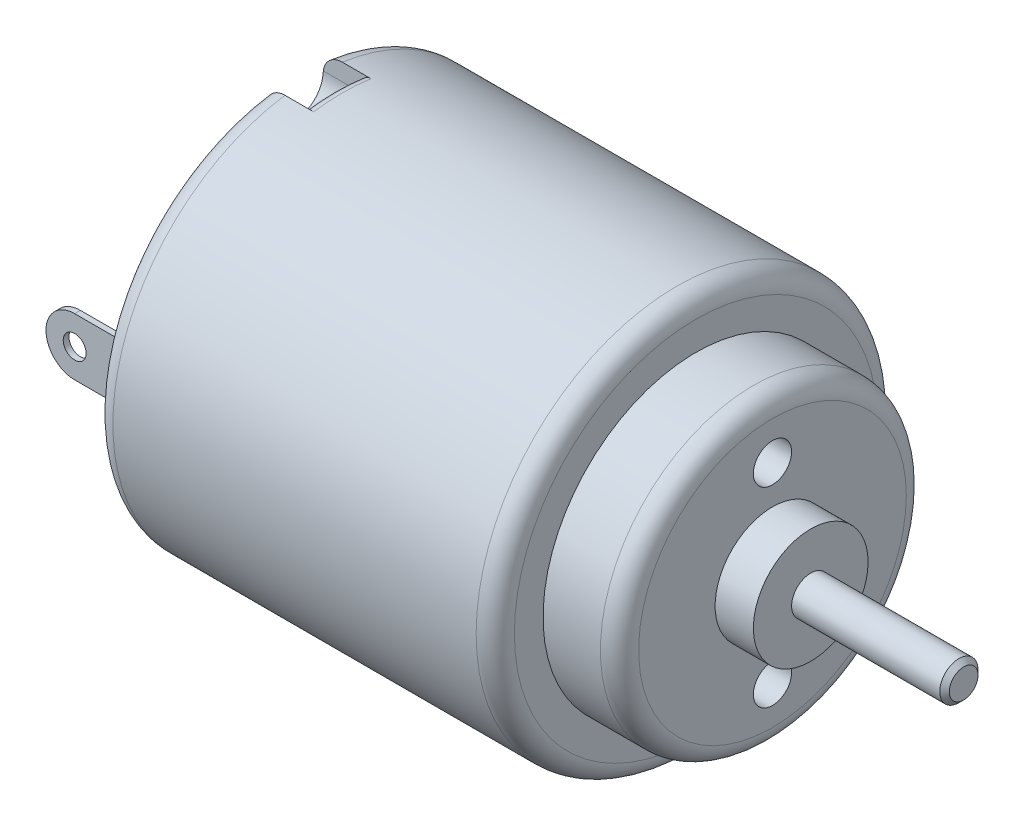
ISO-10303-21;
HEADER;
FILE_DESCRIPTION(('STEP AP214'),'2;1');
FILE_NAME('part.step','',(''),(''),'','','');
FILE_SCHEMA(('AUTOMOTIVE_DESIGN { 1 0 10303 214 1 1 1 1 }'));
ENDSEC;
DATA;
#1=APPLICATION_CONTEXT('core data for automotive mechanical design processes');
#2=APPLICATION_PROTOCOL_DEFINITION('international standard','automotive_design',2000,#1);
#3=PRODUCT_CONTEXT('',#1,'mechanical');
#4=PRODUCT('Part','Part','',(#3));
#5=PRODUCT_RELATED_PRODUCT_CATEGORY('part','',(#4));
#6=PRODUCT_DEFINITION_FORMATION('','',#4);
#7=PRODUCT_DEFINITION_CONTEXT('part definition',#1,'design');
#8=PRODUCT_DEFINITION('design','',#6,#7);
#9=PRODUCT_DEFINITION_SHAPE('','',#8);
#10=(LENGTH_UNIT() NAMED_UNIT(*) SI_UNIT(.MILLI.,.METRE.));
#11=(NAMED_UNIT(*) PLANE_ANGLE_UNIT() SI_UNIT($,.RADIAN.));
#12=(NAMED_UNIT(*) SI_UNIT($,.STERADIAN.) SOLID_ANGLE_UNIT());
#13=UNCERTAINTY_MEASURE_WITH_UNIT(LENGTH_MEASURE(1.E-05),#10,'distance_accuracy_value','');
#14=(GEOMETRIC_REPRESENTATION_CONTEXT(3) GLOBAL_UNCERTAINTY_ASSIGNED_CONTEXT((#13)) GLOBAL_UNIT_ASSIGNED_CONTEXT((#10,
#11,#12)) REPRESENTATION_CONTEXT('',''));
#15=CARTESIAN_POINT('',(0.,0.,0.));
#16=DIRECTION('',(0.,0.,1.));
#17=DIRECTION('',(1.,0.,0.));
#18=AXIS2_PLACEMENT_3D('',#15,#16,#17);
#19=CARTESIAN_POINT('',(-34.,0.,0.));
#20=DIRECTION('',(-1.,0.,0.));
#21=DIRECTION('',(0.,0.,1.));
#22=AXIS2_PLACEMENT_3D('',#19,#20,#21);
#23=TOROIDAL_SURFACE('',#22,9.5,1.);
#24=CARTESIAN_POINT('',(-34.9497102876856,-9.06358544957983,-1.5));
#25=CARTESIAN_POINT('',(-34.9675897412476,-9.1184055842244,-1.5));
#26=CARTESIAN_POINT('',(-34.9807513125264,-9.17474477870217,-1.5));
#27=CARTESIAN_POINT('',(-34.9974747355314,-9.28880377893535,-1.5));
#28=CARTESIAN_POINT('',(-35.001041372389,-9.34652288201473,-1.5));
#29=CARTESIAN_POINT('',(-34.9984285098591,-9.46176924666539,-1.5));
#30=CARTESIAN_POINT('',(-34.992244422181,-9.51929640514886,-1.5));
#31=CARTESIAN_POINT('',(-34.9702879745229,-9.63247595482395,-1.5));
#32=CARTESIAN_POINT('',(-34.9545184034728,-9.6881288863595,-1.5));
#33=CARTESIAN_POINT('',(-34.9142365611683,-9.79482326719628,-1.5));
#34=CARTESIAN_POINT('',(-34.8899170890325,-9.84593755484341,-1.5));
#35=CARTESIAN_POINT('',(-34.8331159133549,-9.94341828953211,-1.5));
#36=CARTESIAN_POINT('',(-34.800633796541,-9.98978449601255,-1.5));
#37=CARTESIAN_POINT('',(-34.7285045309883,-10.0762790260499,-1.5));
#38=CARTESIAN_POINT('',(-34.688883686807,-10.116429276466,-1.5));
#39=CARTESIAN_POINT('',(-34.6034745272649,-10.1895287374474,-1.5));
#40=CARTESIAN_POINT('',(-34.5576861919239,-10.2224779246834,-1.5));
#41=CARTESIAN_POINT('',(-34.4611943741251,-10.2802131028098,-1.5));
#42=CARTESIAN_POINT('',(-34.41048880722,-10.3049956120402,-1.5));
#43=CARTESIAN_POINT('',(-34.3056255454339,-10.3456303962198,-1.5));
#44=CARTESIAN_POINT('',(-34.2514684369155,-10.3614841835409,-1.5));
#45=CARTESIAN_POINT('',(-34.141595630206,-10.3837153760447,-1.5));
#46=CARTESIAN_POINT('',(-34.0858918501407,-10.390151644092,-1.5));
#47=CARTESIAN_POINT('',(-33.9741913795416,-10.3935459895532,-1.5));
#48=CARTESIAN_POINT('',(-33.9181946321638,-10.3905021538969,-1.5));
#49=CARTESIAN_POINT('',(-33.8077263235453,-10.375043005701,-1.5));
#50=CARTESIAN_POINT('',(-33.7532492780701,-10.3626676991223,-1.5));
#51=CARTESIAN_POINT('',(-33.6736977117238,-10.3374154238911,-1.5));
#52=CARTESIAN_POINT('',(-33.6475218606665,-10.3278731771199,-1.5));
#53=CARTESIAN_POINT('',(-33.5960617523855,-10.30662698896,-1.5));
#54=CARTESIAN_POINT('',(-33.5707775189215,-10.2949229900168,-1.5));
#55=CARTESIAN_POINT('',(-33.5460169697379,-10.2821736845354,-1.5));
#56=B_SPLINE_CURVE_WITH_KNOTS('',3,(#24,#25,#26,#27,#28,#29,#30,#31,#32,#33,#34,#35,#36,#37,#38,
#39,#40,#41,#42,#43,#44,#45,#46,#47,#48,#49,#50,#51,#52,#53,#54,#55),.UNSPECIFIED.,.F.,.F.,(4,2,
2,2,2,2,2,2,2,2,2,2,2,2,2,4),(0.,0.172757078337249,0.345427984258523,0.518180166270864,
0.690882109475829,0.859916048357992,1.02895854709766,1.1973904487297,1.36582289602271,
1.53432705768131,1.70280266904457,1.87022068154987,2.03767248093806,2.2044104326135,
2.28790815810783,2.37140810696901),.UNSPECIFIED.);
#57=CARTESIAN_POINT('',(-34.9930501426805,-9.5,-1.5));
#58=VERTEX_POINT('',#57);
#59=CARTESIAN_POINT('',(-34.,-10.3923048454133,-1.5));
#60=VERTEX_POINT('',#59);
#61=EDGE_CURVE('E451',#58,#60,#56,.T.);
#62=ORIENTED_EDGE('',*,*,#61,.F.);
#63=CARTESIAN_POINT('',(-33.9998,-8.4342105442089,-1.05550596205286));
#64=CARTESIAN_POINT('',(-34.0251156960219,-8.43420349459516,-1.05549164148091));
#65=CARTESIAN_POINT('',(-34.0504145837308,-8.43506206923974,-1.05636626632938));
#66=CARTESIAN_POINT('',(-34.1007533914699,-8.43847874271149,-1.05980275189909));
#67=CARTESIAN_POINT('',(-34.1257935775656,-8.44103487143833,-1.06236265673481));
#68=CARTESIAN_POINT('',(-34.1998050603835,-8.45114070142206,-1.07237397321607));
#69=CARTESIAN_POINT('',(-34.2481552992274,-8.46112917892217,-1.08216040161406));
#70=CARTESIAN_POINT('',(-34.3416433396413,-8.48708094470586,-1.10648263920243));
#71=CARTESIAN_POINT('',(-34.3867937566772,-8.50301901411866,-1.1209983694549));
#72=CARTESIAN_POINT('',(-34.4736265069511,-8.54046229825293,-1.15321240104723));
#73=CARTESIAN_POINT('',(-34.5152994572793,-8.56198196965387,-1.17091892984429));
#74=CARTESIAN_POINT('',(-34.6001170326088,-8.61361180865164,-1.21058461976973));
#75=CARTESIAN_POINT('',(-34.642673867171,-8.64449691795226,-1.23279361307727));
#76=CARTESIAN_POINT('',(-34.7219873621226,-8.71282877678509,-1.27750938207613));
#77=CARTESIAN_POINT('',(-34.7587426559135,-8.75027706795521,-1.30001622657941));
#78=CARTESIAN_POINT('',(-34.8286459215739,-8.83519003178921,-1.34556758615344));
#79=CARTESIAN_POINT('',(-34.8611634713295,-8.88325539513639,-1.36847541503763));
#80=CARTESIAN_POINT('',(-34.9168102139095,-8.98611093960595,-1.41031344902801));
#81=CARTESIAN_POINT('',(-34.939950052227,-9.04089340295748,-1.42924815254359));
#82=CARTESIAN_POINT('',(-34.9731572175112,-9.14804623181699,-1.45904524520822));
#83=CARTESIAN_POINT('',(-34.9845293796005,-9.19981023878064,-1.47063546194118));
#84=CARTESIAN_POINT('',(-34.9985326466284,-9.30538269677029,-1.48827752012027));
#85=CARTESIAN_POINT('',(-35.0011818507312,-9.35918667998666,-1.49434081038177));
#86=CARTESIAN_POINT('',(-34.9990566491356,-9.42750554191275,-1.49831968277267));
#87=CARTESIAN_POINT('',(-34.9982845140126,-9.44208660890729,-1.49895298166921));
#88=CARTESIAN_POINT('',(-34.9961179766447,-9.47118796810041,-1.49979320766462));
#89=CARTESIAN_POINT('',(-34.9947247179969,-9.48570832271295,-1.50000091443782));
#90=CARTESIAN_POINT('',(-34.9930267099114,-9.50019999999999,-1.49999998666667));
#91=B_SPLINE_CURVE_WITH_KNOTS('',3,(#63,#64,#65,#66,#67,#68,#69,#70,#71,#72,#73,#74,#75,#76,#77,
#78,#79,#80,#81,#82,#83,#84,#85,#86,#87,#88,#89,#90),.UNSPECIFIED.,.F.,.F.,(4,2,2,2,2,2,2,2,2,2,
2,2,2,4),(0.,0.0758856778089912,0.151683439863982,0.301838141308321,0.451363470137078,
0.601280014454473,0.771844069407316,0.942448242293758,1.12854067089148,1.31442125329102,
1.47623014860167,1.63770309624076,1.68153684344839,1.72529021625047),.UNSPECIFIED.);
#92=CARTESIAN_POINT('',(-35.,-9.38157894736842,-1.49531817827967));
#93=VERTEX_POINT('',#92);
#94=EDGE_CURVE('E479',#93,#58,#91,.T.);
#95=ORIENTED_EDGE('',*,*,#94,.F.);
#96=CARTESIAN_POINT('',(-35.,0.,0.));
#97=DIRECTION('',(-1.,0.,0.));
#98=DIRECTION('',(0.,0.,1.));
#99=AXIS2_PLACEMENT_3D('',#96,#97,#98);
#100=CIRCLE('',#99,9.5);
#101=CARTESIAN_POINT('',(-35.,9.38157894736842,-1.49531817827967));
#102=VERTEX_POINT('',#101);
#103=EDGE_CURVE('E373',#102,#93,#100,.T.);
#104=ORIENTED_EDGE('',*,*,#103,.F.);
#105=CARTESIAN_POINT('',(-34.9930267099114,9.50019999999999,-1.49999998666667));
#106=CARTESIAN_POINT('',(-34.9958334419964,9.47627354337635,-1.5000053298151));
#107=CARTESIAN_POINT('',(-34.9978024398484,9.45225808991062,-1.49943318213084));
#108=CARTESIAN_POINT('',(-35.0000305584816,9.4042046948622,-1.49713102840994));
#109=CARTESIAN_POINT('',(-35.0002897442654,9.38016675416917,-1.49540106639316));
#110=CARTESIAN_POINT('',(-34.9984572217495,9.30848520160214,-1.48849277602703));
#111=CARTESIAN_POINT('',(-34.9937835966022,9.26103578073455,-1.48159609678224));
#112=CARTESIAN_POINT('',(-34.9776266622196,9.16815071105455,-1.46359862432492));
#113=CARTESIAN_POINT('',(-34.9661399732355,9.1227160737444,-1.45249574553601));
#114=CARTESIAN_POINT('',(-34.9368170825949,9.03497875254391,-1.42683091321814));
#115=CARTESIAN_POINT('',(-34.9189778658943,8.99267756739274,-1.41226731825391));
#116=CARTESIAN_POINT('',(-34.8769981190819,8.91082005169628,-1.38016607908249));
#117=CARTESIAN_POINT('',(-34.8526874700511,8.871381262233,-1.36255347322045));
#118=CARTESIAN_POINT('',(-34.7987605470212,8.79712056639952,-1.32577549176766));
#119=CARTESIAN_POINT('',(-34.7691404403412,8.76230202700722,-1.30660900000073));
#120=CARTESIAN_POINT('',(-34.7004226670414,8.69266125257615,-1.26494566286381));
#121=CARTESIAN_POINT('',(-34.6605696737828,8.65862447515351,-1.24238111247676));
#122=CARTESIAN_POINT('',(-34.5753765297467,8.5971990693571,-1.19848932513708));
#123=CARTESIAN_POINT('',(-34.5300326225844,8.56981503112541,-1.17716295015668));
#124=CARTESIAN_POINT('',(-34.4383101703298,8.52397856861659,-1.13938258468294));
#125=CARTESIAN_POINT('',(-34.3923082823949,8.50498486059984,-1.12267464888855));
#126=CARTESIAN_POINT('',(-34.2968686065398,8.47342938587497,-1.09389725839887));
#127=CARTESIAN_POINT('',(-34.2474424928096,8.4608468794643,-1.08181287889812));
#128=CARTESIAN_POINT('',(-34.1647194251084,8.44595216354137,-1.06726332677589));
#129=CARTESIAN_POINT('',(-34.1321191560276,8.44156765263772,-1.06289712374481));
#130=CARTESIAN_POINT('',(-34.0662931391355,8.43568359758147,-1.0569938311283));
#131=CARTESIAN_POINT('',(-34.0330655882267,8.4341943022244,-1.05546679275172));
#132=CARTESIAN_POINT('',(-33.9997999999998,8.43421054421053,-1.05550596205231));
#133=B_SPLINE_CURVE_WITH_KNOTS('',3,(#105,#106,#107,#108,#109,#110,#111,#112,#113,#114,#115,
#116,#117,#118,#119,#120,#121,#122,#123,#124,#125,#126,#127,#128,#129,#130,#131,#132),
.UNSPECIFIED.,.F.,.F.,(4,2,2,2,2,2,2,2,2,2,2,2,2,4),(0.,0.0722300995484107,0.144457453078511,
0.288202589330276,0.432019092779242,0.575903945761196,0.724026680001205,0.872256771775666,
1.04275818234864,1.21337690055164,1.37027045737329,1.52665320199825,1.62596381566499,
1.72562534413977),.UNSPECIFIED.);
#134=CARTESIAN_POINT('',(-34.9930501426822,9.5,-1.5));
#135=VERTEX_POINT('',#134);
#136=EDGE_CURVE('E498',#135,#102,#133,.T.);
#137=ORIENTED_EDGE('',*,*,#136,.F.);
#138=CARTESIAN_POINT('',(-34.9153035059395,8.97271910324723,-1.5));
#139=CARTESIAN_POINT('',(-34.9383021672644,9.02559773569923,-1.5));
#140=CARTESIAN_POINT('',(-34.956738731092,9.08043762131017,-1.5));
#141=CARTESIAN_POINT('',(-34.984178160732,9.19239597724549,-1.5));
#142=CARTESIAN_POINT('',(-34.9931867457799,9.24951304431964,-1.5));
#143=CARTESIAN_POINT('',(-35.0014878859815,9.36442951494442,-1.5));
#144=CARTESIAN_POINT('',(-35.0007838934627,9.42222866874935,-1.5));
#145=CARTESIAN_POINT('',(-34.9896880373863,9.53687679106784,-1.5));
#146=CARTESIAN_POINT('',(-34.9792984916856,9.59372598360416,-1.5));
#147=CARTESIAN_POINT('',(-34.9492565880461,9.70426955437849,-1.5));
#148=CARTESIAN_POINT('',(-34.9297043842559,9.75799115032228,-1.5));
#149=CARTESIAN_POINT('',(-34.8818803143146,9.86141308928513,-1.5));
#150=CARTESIAN_POINT('',(-34.8536074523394,9.91111297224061,-1.5));
#151=CARTESIAN_POINT('',(-34.7890857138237,10.0050663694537,-1.5));
#152=CARTESIAN_POINT('',(-34.7528336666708,10.0493177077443,-1.5));
#153=CARTESIAN_POINT('',(-34.6733616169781,10.1310412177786,-1.5));
#154=CARTESIAN_POINT('',(-34.630142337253,10.1685140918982,-1.5));
#155=CARTESIAN_POINT('',(-34.5383246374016,10.235289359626,-1.5));
#156=CARTESIAN_POINT('',(-34.4897720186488,10.2646547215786,-1.5));
#157=CARTESIAN_POINT('',(-34.3883847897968,10.3147268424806,-1.5));
#158=CARTESIAN_POINT('',(-34.3355500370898,10.3354333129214,-1.5));
#159=CARTESIAN_POINT('',(-34.2276527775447,10.3673973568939,-1.5));
#160=CARTESIAN_POINT('',(-34.1726167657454,10.3787443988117,-1.5));
#161=CARTESIAN_POINT('',(-34.0614300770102,10.3919811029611,-1.5));
#162=CARTESIAN_POINT('',(-34.0052796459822,10.3938728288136,-1.5));
#163=CARTESIAN_POINT('',(-33.8937651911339,10.3881608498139,-1.5));
#164=CARTESIAN_POINT('',(-33.8383985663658,10.3806079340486,-1.5));
#165=CARTESIAN_POINT('',(-33.7297091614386,10.3563221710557,-1.5));
#166=CARTESIAN_POINT('',(-33.6763869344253,10.3395868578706,-1.5));
#167=CARTESIAN_POINT('',(-33.573258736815,10.2974043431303,-1.5));
#168=CARTESIAN_POINT('',(-33.5234538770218,10.2719544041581,-1.5));
#169=CARTESIAN_POINT('',(-33.4524828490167,10.227849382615,-1.5));
#170=CARTESIAN_POINT('',(-33.4294339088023,10.2121464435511,-1.5));
#171=CARTESIAN_POINT('',(-33.3847261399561,10.1788723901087,-1.5));
#172=CARTESIAN_POINT('',(-33.363067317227,10.1613012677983,-1.5));
#173=CARTESIAN_POINT('',(-33.342168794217,10.1428497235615,-1.5));
#174=B_SPLINE_CURVE_WITH_KNOTS('',3,(#138,#139,#140,#141,#142,#143,#144,#145,#146,#147,#148,
#149,#150,#151,#152,#153,#154,#155,#156,#157,#158,#159,#160,#161,#162,#163,#164,#165,#166,#167,
#168,#169,#170,#171,#172,#173),.UNSPECIFIED.,.F.,.F.,(4,2,2,2,2,2,2,2,2,2,2,2,2,2,2,2,2,4),(0.,
0.172757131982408,0.345409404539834,0.518000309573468,0.690549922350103,0.861255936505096,
1.0319814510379,1.20277492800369,1.37355069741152,1.54296019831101,1.71237534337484,
1.8801516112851,2.04789126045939,2.21473274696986,2.38161906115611,2.54855784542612,
2.63214290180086,2.71572831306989),.UNSPECIFIED.);
#175=CARTESIAN_POINT('',(-34.,10.3923048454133,-1.5));
#176=VERTEX_POINT('',#175);
#177=EDGE_CURVE('E540',#176,#135,#174,.F.);
#178=ORIENTED_EDGE('',*,*,#177,.F.);
#179=CARTESIAN_POINT('',(-34.,0.,0.));
#180=DIRECTION('',(-1.,0.,0.));
#181=DIRECTION('',(0.,0.,1.));
#182=AXIS2_PLACEMENT_3D('',#179,#180,#181);
#183=CIRCLE('',#182,10.5);
#184=EDGE_CURVE('E365',#60,#176,#183,.F.);
#185=ORIENTED_EDGE('',*,*,#184,.F.);
#186=EDGE_LOOP('',(#62,#95,#104,#137,#178,#185));
#187=FACE_BOUND('',#186,.T.);
#188=ADVANCED_FACE('F32',(#187),#23,.T.);
#189=CARTESIAN_POINT('',(-35.,2.99999999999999,0.));
#190=DIRECTION('',(-1.,0.,0.));
#191=DIRECTION('',(0.,0.,1.));
#192=AXIS2_PLACEMENT_3D('',#189,#190,#191);
#193=PLANE('',#192);
#194=CARTESIAN_POINT('',(-35.,-9.5,0.));
#195=DIRECTION('',(-1.,0.,0.));
#196=DIRECTION('',(0.,0.,1.));
#197=AXIS2_PLACEMENT_3D('',#194,#195,#196);
#198=CIRCLE('',#197,1.5);
#199=CARTESIAN_POINT('',(-35.,-9.38157894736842,1.49531817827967));
#200=VERTEX_POINT('',#199);
#201=EDGE_CURVE('E192',#200,#93,#198,.T.);
#202=ORIENTED_EDGE('',*,*,#201,.F.);
#203=CARTESIAN_POINT('',(-35.,9.38157894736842,1.49531817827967));
#204=VERTEX_POINT('',#203);
#205=EDGE_CURVE('E372',#200,#204,#100,.T.);
#206=ORIENTED_EDGE('',*,*,#205,.T.);
#207=CARTESIAN_POINT('',(-35.,9.5,0.));
#208=DIRECTION('',(-1.,0.,0.));
#209=DIRECTION('',(0.,0.,1.));
#210=AXIS2_PLACEMENT_3D('',#207,#208,#209);
#211=CIRCLE('',#210,1.5);
#212=EDGE_CURVE('E215',#102,#204,#211,.T.);
#213=ORIENTED_EDGE('',*,*,#212,.F.);
#214=ORIENTED_EDGE('',*,*,#103,.T.);
#215=EDGE_LOOP('',(#202,#206,#213,#214));
#216=FACE_BOUND('',#215,.T.);
#217=DIRECTION('',(0.,0.,1.));
#218=VECTOR('',#217,1.);
#219=CARTESIAN_POINT('',(-35.,-1.5,7.7));
#220=LINE('',#219,#218);
#221=CARTESIAN_POINT('',(-35.,-1.5,7.7));
#222=VERTEX_POINT('',#221);
#223=CARTESIAN_POINT('',(-35.,-1.5,8.));
#224=VERTEX_POINT('',#223);
#225=EDGE_CURVE('E301',#222,#224,#220,.T.);
#226=ORIENTED_EDGE('',*,*,#225,.F.);
#227=DIRECTION('',(0.,-1.,0.));
#228=VECTOR('',#227,1.);
#229=CARTESIAN_POINT('',(-35.,1.5,7.7));
#230=LINE('',#229,#228);
#231=CARTESIAN_POINT('',(-35.,1.5,7.7));
#232=VERTEX_POINT('',#231);
#233=EDGE_CURVE('E298',#232,#222,#230,.T.);
#234=ORIENTED_EDGE('',*,*,#233,.F.);
#235=DIRECTION('',(0.,0.,-1.));
#236=VECTOR('',#235,1.);
#237=CARTESIAN_POINT('',(-35.,1.5,7.7));
#238=LINE('',#237,#236);
#239=CARTESIAN_POINT('',(-35.,1.5,8.));
#240=VERTEX_POINT('',#239);
#241=EDGE_CURVE('E306',#240,#232,#238,.T.);
#242=ORIENTED_EDGE('',*,*,#241,.F.);
#243=DIRECTION('',(0.,1.,0.));
#244=VECTOR('',#243,1.);
#245=CARTESIAN_POINT('',(-35.,1.5,8.));
#246=LINE('',#245,#244);
#247=EDGE_CURVE('E303',#224,#240,#246,.T.);
#248=ORIENTED_EDGE('',*,*,#247,.F.);
#249=EDGE_LOOP('',(#226,#234,#242,#248));
#250=FACE_BOUND('',#249,.T.);
#251=DIRECTION('',(0.,0.,-1.));
#252=VECTOR('',#251,1.);
#253=CARTESIAN_POINT('',(-35.,2.5,-3.));
#254=LINE('',#253,#252);
#255=CARTESIAN_POINT('',(-35.,2.5,1.65831239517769));
#256=VERTEX_POINT('',#255);
#257=CARTESIAN_POINT('',(-35.,2.5,-1.65831239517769));
#258=VERTEX_POINT('',#257);
#259=EDGE_CURVE('E324',#256,#258,#254,.T.);
#260=ORIENTED_EDGE('',*,*,#259,.F.);
#261=CARTESIAN_POINT('',(-35.,0.,0.));
#262=DIRECTION('',(1.,0.,0.));
#263=DIRECTION('',(0.,0.,-1.));
#264=AXIS2_PLACEMENT_3D('',#261,#262,#263);
#265=CIRCLE('',#264,2.99999999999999);
#266=EDGE_CURVE('E341',#256,#258,#265,.T.);
#267=ORIENTED_EDGE('',*,*,#266,.T.);
#268=EDGE_LOOP('',(#260,#267));
#269=FACE_BOUND('',#268,.T.);
#270=DIRECTION('',(0.,0.,1.));
#271=VECTOR('',#270,1.);
#272=CARTESIAN_POINT('',(-35.,-1.5,-8.));
#273=LINE('',#272,#271);
#274=CARTESIAN_POINT('',(-35.,-1.5,-8.));
#275=VERTEX_POINT('',#274);
#276=CARTESIAN_POINT('',(-35.,-1.5,-7.7));
#277=VERTEX_POINT('',#276);
#278=EDGE_CURVE('E275',#275,#277,#273,.T.);
#279=ORIENTED_EDGE('',*,*,#278,.F.);
#280=DIRECTION('',(0.,-1.,0.));
#281=VECTOR('',#280,1.);
#282=CARTESIAN_POINT('',(-35.,1.5,-8.));
#283=LINE('',#282,#281);
#284=CARTESIAN_POINT('',(-35.,1.5,-8.));
#285=VERTEX_POINT('',#284);
#286=EDGE_CURVE('E272',#285,#275,#283,.T.);
#287=ORIENTED_EDGE('',*,*,#286,.F.);
#288=DIRECTION('',(0.,0.,-1.));
#289=VECTOR('',#288,1.);
#290=CARTESIAN_POINT('',(-35.,1.5,-8.));
#291=LINE('',#290,#289);
#292=CARTESIAN_POINT('',(-35.,1.5,-7.7));
#293=VERTEX_POINT('',#292);
#294=EDGE_CURVE('E280',#293,#285,#291,.T.);
#295=ORIENTED_EDGE('',*,*,#294,.F.);
#296=DIRECTION('',(0.,1.,0.));
#297=VECTOR('',#296,1.);
#298=CARTESIAN_POINT('',(-35.,1.5,-7.7));
#299=LINE('',#298,#297);
#300=EDGE_CURVE('E277',#277,#293,#299,.T.);
#301=ORIENTED_EDGE('',*,*,#300,.F.);
#302=EDGE_LOOP('',(#279,#287,#295,#301));
#303=FACE_BOUND('',#302,.T.);
#304=ADVANCED_FACE('F511',(#216,#250,#269,#303),#193,.T.);
#305=CARTESIAN_POINT('',(23.3,0.,0.));
#306=DIRECTION('',(1.,0.,0.));
#307=DIRECTION('',(0.,0.,-1.));
#308=AXIS2_PLACEMENT_3D('',#305,#306,#307);
#309=CYLINDRICAL_SURFACE('',#308,2.99999999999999);
#310=ORIENTED_EDGE('',*,*,#266,.F.);
#311=DIRECTION('',(1.,0.,0.));
#312=VECTOR('',#311,1.);
#313=CARTESIAN_POINT('',(23.3,2.5,1.65831239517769));
#314=LINE('',#313,#312);
#315=CARTESIAN_POINT('',(-37.,2.5,1.65831239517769));
#316=VERTEX_POINT('',#315);
#317=EDGE_CURVE('E329',#256,#316,#314,.F.);
#318=ORIENTED_EDGE('',*,*,#317,.T.);
#319=CARTESIAN_POINT('',(-37.,0.,0.));
#320=DIRECTION('',(1.,0.,0.));
#321=DIRECTION('',(0.,0.,-1.));
#322=AXIS2_PLACEMENT_3D('',#319,#320,#321);
#323=CIRCLE('',#322,2.99999999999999);
#324=CARTESIAN_POINT('',(-37.,2.5,-1.65831239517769));
#325=VERTEX_POINT('',#324);
#326=EDGE_CURVE('E338',#316,#325,#323,.T.);
#327=ORIENTED_EDGE('',*,*,#326,.T.);
#328=DIRECTION('',(1.,0.,0.));
#329=VECTOR('',#328,1.);
#330=CARTESIAN_POINT('',(23.3,2.5,-1.65831239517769));
#331=LINE('',#330,#329);
#332=EDGE_CURVE('E326',#325,#258,#331,.T.);
#333=ORIENTED_EDGE('',*,*,#332,.T.);
#334=EDGE_LOOP('',(#310,#318,#327,#333));
#335=FACE_BOUND('',#334,.T.);
#336=ADVANCED_FACE('F516',(#335),#309,.T.);
#337=CARTESIAN_POINT('',(-37.,0.999999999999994,0.));
#338=DIRECTION('',(-1.,0.,0.));
#339=DIRECTION('',(0.,0.,1.));
#340=AXIS2_PLACEMENT_3D('',#337,#338,#339);
#341=PLANE('',#340);
#342=CARTESIAN_POINT('',(-37.,0.,0.));
#343=DIRECTION('',(1.,0.,0.));
#344=DIRECTION('',(0.,0.,-1.));
#345=AXIS2_PLACEMENT_3D('',#342,#343,#344);
#346=CIRCLE('',#345,0.999999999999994);
#347=CARTESIAN_POINT('',(-37.,0.,-0.999999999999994));
#348=VERTEX_POINT('',#347);
#349=EDGE_CURVE('E335',#348,#348,#346,.T.);
#350=ORIENTED_EDGE('',*,*,#349,.T.);
#351=EDGE_LOOP('',(#350));
#352=FACE_BOUND('',#351,.T.);
#353=ORIENTED_EDGE('',*,*,#326,.F.);
#354=DIRECTION('',(0.,0.,-1.));
#355=VECTOR('',#354,1.);
#356=CARTESIAN_POINT('',(-37.,2.5,0.));
#357=LINE('',#356,#355);
#358=EDGE_CURVE('E376',#316,#325,#357,.T.);
#359=ORIENTED_EDGE('',*,*,#358,.T.);
#360=EDGE_LOOP('',(#353,#359));
#361=FACE_BOUND('',#360,.T.);
#362=ADVANCED_FACE('F655',(#352,#361),#341,.T.);
#363=CARTESIAN_POINT('',(0.,1.,0.));
#364=DIRECTION('',(1.,0.,0.));
#365=DIRECTION('',(0.,0.,-1.));
#366=AXIS2_PLACEMENT_3D('',#363,#364,#365);
#367=PLANE('',#366);
#368=CARTESIAN_POINT('',(0.,0.,0.));
#369=DIRECTION('',(1.,0.,0.));
#370=DIRECTION('',(0.,0.,-1.));
#371=AXIS2_PLACEMENT_3D('',#368,#369,#370);
#372=CIRCLE('',#371,0.749999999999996);
#373=CARTESIAN_POINT('',(0.,0.,-0.749999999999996));
#374=VERTEX_POINT('',#373);
#375=EDGE_CURVE('E379',#374,#374,#372,.T.);
#376=ORIENTED_EDGE('',*,*,#375,.T.);
#377=EDGE_LOOP('',(#376));
#378=FACE_BOUND('',#377,.T.);
#379=ADVANCED_FACE('F34',(#378),#367,.T.);
#380=CARTESIAN_POINT('',(23.3,0.,0.));
#381=DIRECTION('',(1.,0.,0.));
#382=DIRECTION('',(0.,0.,-1.));
#383=AXIS2_PLACEMENT_3D('',#380,#381,#382);
#384=CYLINDRICAL_SURFACE('',#383,1.);
#385=CARTESIAN_POINT('',(-0.250000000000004,0.,0.));
#386=DIRECTION('',(1.,0.,0.));
#387=DIRECTION('',(0.,0.,-1.));
#388=AXIS2_PLACEMENT_3D('',#385,#386,#387);
#389=CIRCLE('',#388,1.);
#390=CARTESIAN_POINT('',(-0.250000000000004,0.,-1.));
#391=VERTEX_POINT('',#390);
#392=EDGE_CURVE('E382',#391,#391,#389,.F.);
#393=ORIENTED_EDGE('',*,*,#392,.T.);
#394=EDGE_LOOP('',(#393));
#395=FACE_BOUND('',#394,.T.);
#396=CARTESIAN_POINT('',(-8.,0.,0.));
#397=DIRECTION('',(1.,0.,0.));
#398=DIRECTION('',(0.,0.,-1.));
#399=AXIS2_PLACEMENT_3D('',#396,#397,#398);
#400=CIRCLE('',#399,1.);
#401=CARTESIAN_POINT('',(-8.,0.,-1.));
#402=VERTEX_POINT('',#401);
#403=EDGE_CURVE('E353',#402,#402,#400,.T.);
#404=ORIENTED_EDGE('',*,*,#403,.T.);
#405=EDGE_LOOP('',(#404));
#406=FACE_BOUND('',#405,.T.);
#407=ADVANCED_FACE('F663',(#395,#406),#384,.T.);
#408=CARTESIAN_POINT('',(-8.,3.,0.));
#409=DIRECTION('',(1.,0.,0.));
#410=DIRECTION('',(0.,0.,-1.));
#411=AXIS2_PLACEMENT_3D('',#408,#409,#410);
#412=PLANE('',#411);
#413=CARTESIAN_POINT('',(-8.,0.,0.));
#414=DIRECTION('',(1.,0.,0.));
#415=DIRECTION('',(0.,0.,-1.));
#416=AXIS2_PLACEMENT_3D('',#413,#414,#415);
#417=CIRCLE('',#416,3.);
#418=CARTESIAN_POINT('',(-8.,0.,-3.));
#419=VERTEX_POINT('',#418);
#420=EDGE_CURVE('E350',#419,#419,#417,.T.);
#421=ORIENTED_EDGE('',*,*,#420,.T.);
#422=EDGE_LOOP('',(#421));
#423=FACE_BOUND('',#422,.T.);
#424=ORIENTED_EDGE('',*,*,#403,.F.);
#425=EDGE_LOOP('',(#424));
#426=FACE_BOUND('',#425,.T.);
#427=ADVANCED_FACE('F687',(#423,#426),#412,.T.);
#428=CARTESIAN_POINT('',(23.3,0.,0.));
#429=DIRECTION('',(1.,0.,0.));
#430=DIRECTION('',(0.,0.,-1.));
#431=AXIS2_PLACEMENT_3D('',#428,#429,#430);
#432=CYLINDRICAL_SURFACE('',#431,3.);
#433=CARTESIAN_POINT('',(-10.,0.,0.));
#434=DIRECTION('',(1.,0.,0.));
#435=DIRECTION('',(0.,0.,-1.));
#436=AXIS2_PLACEMENT_3D('',#433,#434,#435);
#437=CIRCLE('',#436,3.);
#438=CARTESIAN_POINT('',(-10.,0.,-3.));
#439=VERTEX_POINT('',#438);
#440=EDGE_CURVE('E347',#439,#439,#437,.T.);
#441=ORIENTED_EDGE('',*,*,#440,.T.);
#442=EDGE_LOOP('',(#441));
#443=FACE_BOUND('',#442,.T.);
#444=ORIENTED_EDGE('',*,*,#420,.F.);
#445=EDGE_LOOP('',(#444));
#446=FACE_BOUND('',#445,.T.);
#447=ADVANCED_FACE('F683',(#443,#446),#432,.T.);
#448=CARTESIAN_POINT('',(-10.,8.,0.));
#449=DIRECTION('',(1.,0.,0.));
#450=DIRECTION('',(0.,0.,-1.));
#451=AXIS2_PLACEMENT_3D('',#448,#449,#450);
#452=PLANE('',#451);
#453=CARTESIAN_POINT('',(-10.,-5.,0.));
#454=DIRECTION('',(1.,0.,0.));
#455=DIRECTION('',(0.,0.,-1.));
#456=AXIS2_PLACEMENT_3D('',#453,#454,#455);
#457=CIRCLE('',#456,1.);
#458=CARTESIAN_POINT('',(-10.,-5.,-1.));
#459=VERTEX_POINT('',#458);
#460=EDGE_CURVE('E236',#459,#459,#457,.T.);
#461=ORIENTED_EDGE('',*,*,#460,.F.);
#462=EDGE_LOOP('',(#461));
#463=FACE_BOUND('',#462,.T.);
#464=CARTESIAN_POINT('',(-10.,5.,0.));
#465=DIRECTION('',(1.,0.,0.));
#466=DIRECTION('',(0.,0.,-1.));
#467=AXIS2_PLACEMENT_3D('',#464,#465,#466);
#468=CIRCLE('',#467,1.);
#469=CARTESIAN_POINT('',(-10.,5.,-1.));
#470=VERTEX_POINT('',#469);
#471=EDGE_CURVE('E242',#470,#470,#468,.T.);
#472=ORIENTED_EDGE('',*,*,#471,.F.);
#473=EDGE_LOOP('',(#472));
#474=FACE_BOUND('',#473,.T.);
#475=CARTESIAN_POINT('',(-10.,0.,0.));
#476=DIRECTION('',(1.,0.,0.));
#477=DIRECTION('',(0.,0.,-1.));
#478=AXIS2_PLACEMENT_3D('',#475,#476,#477);
#479=CIRCLE('',#478,7.);
#480=CARTESIAN_POINT('',(-10.,0.,-7.));
#481=VERTEX_POINT('',#480);
#482=EDGE_CURVE('E356',#481,#481,#479,.T.);
#483=ORIENTED_EDGE('',*,*,#482,.T.);
#484=EDGE_LOOP('',(#483));
#485=FACE_BOUND('',#484,.T.);
#486=ORIENTED_EDGE('',*,*,#440,.F.);
#487=EDGE_LOOP('',(#486));
#488=FACE_BOUND('',#487,.T.);
#489=ADVANCED_FACE('F679',(#463,#474,#485,#488),#452,.T.);
#490=CARTESIAN_POINT('',(23.3,0.,0.));
#491=DIRECTION('',(1.,0.,0.));
#492=DIRECTION('',(0.,0.,-1.));
#493=AXIS2_PLACEMENT_3D('',#490,#491,#492);
#494=CYLINDRICAL_SURFACE('',#493,8.);
#495=CARTESIAN_POINT('',(-11.,0.,0.));
#496=DIRECTION('',(1.,0.,0.));
#497=DIRECTION('',(0.,0.,-1.));
#498=AXIS2_PLACEMENT_3D('',#495,#496,#497);
#499=CIRCLE('',#498,8.);
#500=CARTESIAN_POINT('',(-11.,0.,-8.));
#501=VERTEX_POINT('',#500);
#502=EDGE_CURVE('E359',#501,#501,#499,.F.);
#503=ORIENTED_EDGE('',*,*,#502,.T.);
#504=EDGE_LOOP('',(#503));
#505=FACE_BOUND('',#504,.T.);
#506=CARTESIAN_POINT('',(-14.,0.,0.));
#507=DIRECTION('',(1.,0.,0.));
#508=DIRECTION('',(0.,0.,-1.));
#509=AXIS2_PLACEMENT_3D('',#506,#507,#508);
#510=CIRCLE('',#509,8.);
#511=CARTESIAN_POINT('',(-14.,0.,-8.));
#512=VERTEX_POINT('',#511);
#513=EDGE_CURVE('E344',#512,#512,#510,.T.);
#514=ORIENTED_EDGE('',*,*,#513,.T.);
#515=EDGE_LOOP('',(#514));
#516=FACE_BOUND('',#515,.T.);
#517=ADVANCED_FACE('F675',(#505,#516),#494,.T.);
#518=CARTESIAN_POINT('',(-14.,10.5,0.));
#519=DIRECTION('',(1.,0.,0.));
#520=DIRECTION('',(0.,0.,-1.));
#521=AXIS2_PLACEMENT_3D('',#518,#519,#520);
#522=PLANE('',#521);
#523=CARTESIAN_POINT('',(-14.,0.,0.));
#524=DIRECTION('',(1.,0.,0.));
#525=DIRECTION('',(0.,0.,-1.));
#526=AXIS2_PLACEMENT_3D('',#523,#524,#525);
#527=CIRCLE('',#526,9.5);
#528=CARTESIAN_POINT('',(-14.,0.,-9.5));
#529=VERTEX_POINT('',#528);
#530=EDGE_CURVE('E362',#529,#529,#527,.T.);
#531=ORIENTED_EDGE('',*,*,#530,.T.);
#532=EDGE_LOOP('',(#531));
#533=FACE_BOUND('',#532,.T.);
#534=ORIENTED_EDGE('',*,*,#513,.F.);
#535=EDGE_LOOP('',(#534));
#536=FACE_BOUND('',#535,.T.);
#537=ADVANCED_FACE('F672',(#533,#536),#522,.T.);
#538=CARTESIAN_POINT('',(23.3,0.,0.));
#539=DIRECTION('',(1.,0.,0.));
#540=DIRECTION('',(0.,0.,-1.));
#541=AXIS2_PLACEMENT_3D('',#538,#539,#540);
#542=CYLINDRICAL_SURFACE('',#541,10.5);
#543=CARTESIAN_POINT('',(-32.5,0.,0.));
#544=DIRECTION('',(-1.,0.,0.));
#545=DIRECTION('',(0.,0.,1.));
#546=AXIS2_PLACEMENT_3D('',#543,#544,#545);
#547=CIRCLE('',#546,10.5);
#548=CARTESIAN_POINT('',(-32.5,-10.3923048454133,1.5));
#549=VERTEX_POINT('',#548);
#550=CARTESIAN_POINT('',(-32.5,-10.3923048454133,-1.5));
#551=VERTEX_POINT('',#550);
#552=EDGE_CURVE('E462',#549,#551,#547,.F.);
#553=ORIENTED_EDGE('',*,*,#552,.T.);
#554=DIRECTION('',(1.,0.,0.));
#555=VECTOR('',#554,1.);
#556=CARTESIAN_POINT('',(23.3,-10.3923048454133,-1.5));
#557=LINE('',#556,#555);
#558=EDGE_CURVE('E213',#60,#551,#557,.T.);
#559=ORIENTED_EDGE('',*,*,#558,.F.);
#560=ORIENTED_EDGE('',*,*,#184,.T.);
#561=DIRECTION('',(1.,0.,0.));
#562=VECTOR('',#561,1.);
#563=CARTESIAN_POINT('',(23.3,10.3923048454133,-1.5));
#564=LINE('',#563,#562);
#565=CARTESIAN_POINT('',(-32.5,10.3923048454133,-1.5));
#566=VERTEX_POINT('',#565);
#567=EDGE_CURVE('E233',#566,#176,#564,.F.);
#568=ORIENTED_EDGE('',*,*,#567,.F.);
#569=CARTESIAN_POINT('',(-32.5,0.,0.));
#570=DIRECTION('',(-1.,0.,0.));
#571=DIRECTION('',(0.,0.,1.));
#572=AXIS2_PLACEMENT_3D('',#569,#570,#571);
#573=CIRCLE('',#572,10.5);
#574=CARTESIAN_POINT('',(-32.5,10.3923048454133,1.5));
#575=VERTEX_POINT('',#574);
#576=EDGE_CURVE('E477',#566,#575,#573,.F.);
#577=ORIENTED_EDGE('',*,*,#576,.T.);
#578=DIRECTION('',(1.,0.,0.));
#579=VECTOR('',#578,1.);
#580=CARTESIAN_POINT('',(23.3,10.3923048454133,1.5));
#581=LINE('',#580,#579);
#582=CARTESIAN_POINT('',(-34.,10.3923048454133,1.5));
#583=VERTEX_POINT('',#582);
#584=EDGE_CURVE('E230',#583,#575,#581,.T.);
#585=ORIENTED_EDGE('',*,*,#584,.F.);
#586=CARTESIAN_POINT('',(-34.,-10.3923048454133,1.5));
#587=VERTEX_POINT('',#586);
#588=EDGE_CURVE('E366',#583,#587,#183,.F.);
#589=ORIENTED_EDGE('',*,*,#588,.T.);
#590=DIRECTION('',(1.,0.,0.));
#591=VECTOR('',#590,1.);
#592=CARTESIAN_POINT('',(23.3,-10.3923048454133,1.5));
#593=LINE('',#592,#591);
#594=EDGE_CURVE('E210',#549,#587,#593,.F.);
#595=ORIENTED_EDGE('',*,*,#594,.F.);
#596=EDGE_LOOP('',(#553,#559,#560,#568,#577,#585,#589,#595));
#597=FACE_BOUND('',#596,.T.);
#598=CARTESIAN_POINT('',(-15.,0.,0.));
#599=DIRECTION('',(1.,0.,0.));
#600=DIRECTION('',(0.,0.,-1.));
#601=AXIS2_PLACEMENT_3D('',#598,#599,#600);
#602=CIRCLE('',#601,10.5);
#603=CARTESIAN_POINT('',(-15.,0.,-10.5));
#604=VERTEX_POINT('',#603);
#605=EDGE_CURVE('E369',#604,#604,#602,.F.);
#606=ORIENTED_EDGE('',*,*,#605,.T.);
#607=EDGE_LOOP('',(#606));
#608=FACE_BOUND('',#607,.T.);
#609=ADVANCED_FACE('F541',(#597,#608),#542,.T.);
#610=CARTESIAN_POINT('',(23.3,0.,0.));
#611=DIRECTION('',(1.,0.,0.));
#612=DIRECTION('',(0.,0.,-1.));
#613=AXIS2_PLACEMENT_3D('',#610,#611,#612);
#614=CYLINDRICAL_SURFACE('',#613,0.999999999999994);
#615=CARTESIAN_POINT('',(-38.,0.,0.));
#616=DIRECTION('',(1.,0.,0.));
#617=DIRECTION('',(0.,0.,-1.));
#618=AXIS2_PLACEMENT_3D('',#615,#616,#617);
#619=CIRCLE('',#618,0.999999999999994);
#620=CARTESIAN_POINT('',(-38.,0.,-0.999999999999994));
#621=VERTEX_POINT('',#620);
#622=EDGE_CURVE('E332',#621,#621,#619,.T.);
#623=ORIENTED_EDGE('',*,*,#622,.T.);
#624=EDGE_LOOP('',(#623));
#625=FACE_BOUND('',#624,.T.);
#626=ORIENTED_EDGE('',*,*,#349,.F.);
#627=EDGE_LOOP('',(#626));
#628=FACE_BOUND('',#627,.T.);
#629=ADVANCED_FACE('F667',(#625,#628),#614,.T.);
#630=CARTESIAN_POINT('',(-38.,0.,0.));
#631=DIRECTION('',(-1.,0.,0.));
#632=DIRECTION('',(0.,0.,1.));
#633=AXIS2_PLACEMENT_3D('',#630,#631,#632);
#634=PLANE('',#633);
#635=ORIENTED_EDGE('',*,*,#622,.F.);
#636=EDGE_LOOP('',(#635));
#637=FACE_BOUND('',#636,.T.);
#638=ADVANCED_FACE('F733',(#637),#634,.T.);
#639=CARTESIAN_POINT('',(-11.,0.,0.));
#640=DIRECTION('',(1.,0.,0.));
#641=DIRECTION('',(0.,0.,-1.));
#642=AXIS2_PLACEMENT_3D('',#639,#640,#641);
#643=TOROIDAL_SURFACE('',#642,7.,1.);
#644=ORIENTED_EDGE('',*,*,#502,.F.);
#645=EDGE_LOOP('',(#644));
#646=FACE_BOUND('',#645,.T.);
#647=ORIENTED_EDGE('',*,*,#482,.F.);
#648=EDGE_LOOP('',(#647));
#649=FACE_BOUND('',#648,.T.);
#650=ADVANCED_FACE('F529',(#646,#649),#643,.T.);
#651=CARTESIAN_POINT('',(-15.,0.,0.));
#652=DIRECTION('',(1.,0.,0.));
#653=DIRECTION('',(0.,0.,-1.));
#654=AXIS2_PLACEMENT_3D('',#651,#652,#653);
#655=TOROIDAL_SURFACE('',#654,9.5,1.);
#656=ORIENTED_EDGE('',*,*,#605,.F.);
#657=EDGE_LOOP('',(#656));
#658=FACE_BOUND('',#657,.T.);
#659=ORIENTED_EDGE('',*,*,#530,.F.);
#660=EDGE_LOOP('',(#659));
#661=FACE_BOUND('',#660,.T.);
#662=ADVANCED_FACE('F521',(#658,#661),#655,.T.);
#663=CARTESIAN_POINT('',(-34.9930267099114,-9.50019999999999,1.49999998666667));
#664=CARTESIAN_POINT('',(-34.9958334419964,-9.47627354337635,1.5000053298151));
#665=CARTESIAN_POINT('',(-34.9978024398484,-9.45225808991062,1.49943318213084));
#666=CARTESIAN_POINT('',(-35.0000305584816,-9.4042046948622,1.49713102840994));
#667=CARTESIAN_POINT('',(-35.0002897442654,-9.38016675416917,1.49540106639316));
#668=CARTESIAN_POINT('',(-34.9984572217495,-9.30848520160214,1.48849277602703));
#669=CARTESIAN_POINT('',(-34.9937835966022,-9.26103578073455,1.48159609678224));
#670=CARTESIAN_POINT('',(-34.9776266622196,-9.16815071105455,1.46359862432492));
#671=CARTESIAN_POINT('',(-34.9661399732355,-9.1227160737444,1.45249574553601));
#672=CARTESIAN_POINT('',(-34.9368170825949,-9.03497875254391,1.42683091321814));
#673=CARTESIAN_POINT('',(-34.9189778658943,-8.99267756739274,1.41226731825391));
#674=CARTESIAN_POINT('',(-34.8769981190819,-8.91082005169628,1.38016607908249));
#675=CARTESIAN_POINT('',(-34.8526874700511,-8.871381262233,1.36255347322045));
#676=CARTESIAN_POINT('',(-34.7987605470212,-8.79712056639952,1.32577549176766));
#677=CARTESIAN_POINT('',(-34.7691404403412,-8.76230202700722,1.30660900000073));
#678=CARTESIAN_POINT('',(-34.7004226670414,-8.69266125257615,1.26494566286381));
#679=CARTESIAN_POINT('',(-34.6605696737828,-8.65862447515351,1.24238111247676));
#680=CARTESIAN_POINT('',(-34.5753765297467,-8.5971990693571,1.19848932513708));
#681=CARTESIAN_POINT('',(-34.5300326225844,-8.56981503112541,1.17716295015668));
#682=CARTESIAN_POINT('',(-34.4383101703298,-8.52397856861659,1.13938258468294));
#683=CARTESIAN_POINT('',(-34.3923082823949,-8.50498486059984,1.12267464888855));
#684=CARTESIAN_POINT('',(-34.2968686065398,-8.47342938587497,1.09389725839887));
#685=CARTESIAN_POINT('',(-34.2474424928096,-8.4608468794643,1.08181287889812));
#686=CARTESIAN_POINT('',(-34.1647194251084,-8.44595216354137,1.06726332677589));
#687=CARTESIAN_POINT('',(-34.1321191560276,-8.44156765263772,1.06289712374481));
#688=CARTESIAN_POINT('',(-34.0662931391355,-8.43568359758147,1.0569938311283));
#689=CARTESIAN_POINT('',(-34.0330655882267,-8.4341943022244,1.05546679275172));
#690=CARTESIAN_POINT('',(-33.9997999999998,-8.43421054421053,1.05550596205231));
#691=B_SPLINE_CURVE_WITH_KNOTS('',3,(#663,#664,#665,#666,#667,#668,#669,#670,#671,#672,#673,
#674,#675,#676,#677,#678,#679,#680,#681,#682,#683,#684,#685,#686,#687,#688,#689,#690),
.UNSPECIFIED.,.F.,.F.,(4,2,2,2,2,2,2,2,2,2,2,2,2,4),(0.,0.0722300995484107,0.144457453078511,
0.288202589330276,0.432019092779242,0.575903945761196,0.724026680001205,0.872256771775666,
1.04275818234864,1.21337690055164,1.37027045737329,1.52665320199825,1.62596381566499,
1.72562534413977),.UNSPECIFIED.);
#692=CARTESIAN_POINT('',(-34.9930501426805,-9.5,1.5));
#693=VERTEX_POINT('',#692);
#694=EDGE_CURVE('E481',#693,#200,#691,.T.);
#695=ORIENTED_EDGE('',*,*,#694,.F.);
#696=CARTESIAN_POINT('',(-34.9497102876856,-9.06358544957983,1.5));
#697=CARTESIAN_POINT('',(-34.9675897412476,-9.1184055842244,1.5));
#698=CARTESIAN_POINT('',(-34.9807513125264,-9.17474477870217,1.5));
#699=CARTESIAN_POINT('',(-34.9974747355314,-9.28880377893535,1.5));
#700=CARTESIAN_POINT('',(-35.001041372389,-9.34652288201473,1.5));
#701=CARTESIAN_POINT('',(-34.9984285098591,-9.46176924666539,1.5));
#702=CARTESIAN_POINT('',(-34.992244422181,-9.51929640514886,1.5));
#703=CARTESIAN_POINT('',(-34.9702879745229,-9.63247595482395,1.5));
#704=CARTESIAN_POINT('',(-34.9545184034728,-9.6881288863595,1.5));
#705=CARTESIAN_POINT('',(-34.9142365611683,-9.79482326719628,1.5));
#706=CARTESIAN_POINT('',(-34.8899170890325,-9.84593755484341,1.5));
#707=CARTESIAN_POINT('',(-34.8331159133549,-9.94341828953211,1.5));
#708=CARTESIAN_POINT('',(-34.800633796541,-9.98978449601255,1.5));
#709=CARTESIAN_POINT('',(-34.7285045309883,-10.0762790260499,1.5));
#710=CARTESIAN_POINT('',(-34.688883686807,-10.116429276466,1.5));
#711=CARTESIAN_POINT('',(-34.6034745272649,-10.1895287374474,1.5));
#712=CARTESIAN_POINT('',(-34.5576861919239,-10.2224779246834,1.5));
#713=CARTESIAN_POINT('',(-34.4611943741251,-10.2802131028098,1.5));
#714=CARTESIAN_POINT('',(-34.41048880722,-10.3049956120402,1.5));
#715=CARTESIAN_POINT('',(-34.3056255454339,-10.3456303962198,1.5));
#716=CARTESIAN_POINT('',(-34.2514684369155,-10.3614841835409,1.5));
#717=CARTESIAN_POINT('',(-34.141595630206,-10.3837153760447,1.5));
#718=CARTESIAN_POINT('',(-34.0858918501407,-10.390151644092,1.5));
#719=CARTESIAN_POINT('',(-33.9741913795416,-10.3935459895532,1.5));
#720=CARTESIAN_POINT('',(-33.9181946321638,-10.3905021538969,1.5));
#721=CARTESIAN_POINT('',(-33.8077263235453,-10.375043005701,1.5));
#722=CARTESIAN_POINT('',(-33.7532492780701,-10.3626676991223,1.5));
#723=CARTESIAN_POINT('',(-33.6736977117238,-10.3374154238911,1.5));
#724=CARTESIAN_POINT('',(-33.6475218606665,-10.3278731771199,1.5));
#725=CARTESIAN_POINT('',(-33.5960617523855,-10.30662698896,1.5));
#726=CARTESIAN_POINT('',(-33.5707775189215,-10.2949229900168,1.5));
#727=CARTESIAN_POINT('',(-33.5460169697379,-10.2821736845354,1.5));
#728=B_SPLINE_CURVE_WITH_KNOTS('',3,(#696,#697,#698,#699,#700,#701,#702,#703,#704,#705,#706,
#707,#708,#709,#710,#711,#712,#713,#714,#715,#716,#717,#718,#719,#720,#721,#722,#723,#724,#725,
#726,#727),.UNSPECIFIED.,.F.,.F.,(4,2,2,2,2,2,2,2,2,2,2,2,2,2,2,4),(0.,0.172757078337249,
0.345427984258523,0.518180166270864,0.690882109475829,0.859916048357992,1.02895854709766,
1.1973904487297,1.36582289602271,1.53432705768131,1.70280266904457,1.87022068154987,
2.03767248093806,2.2044104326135,2.28790815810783,2.37140810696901),.UNSPECIFIED.);
#729=EDGE_CURVE('E198',#587,#693,#728,.F.);
#730=ORIENTED_EDGE('',*,*,#729,.F.);
#731=ORIENTED_EDGE('',*,*,#588,.F.);
#732=CARTESIAN_POINT('',(-34.9153035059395,8.97271910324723,1.5));
#733=CARTESIAN_POINT('',(-34.9383021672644,9.02559773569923,1.5));
#734=CARTESIAN_POINT('',(-34.956738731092,9.08043762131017,1.5));
#735=CARTESIAN_POINT('',(-34.984178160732,9.19239597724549,1.5));
#736=CARTESIAN_POINT('',(-34.9931867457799,9.24951304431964,1.5));
#737=CARTESIAN_POINT('',(-35.0014878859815,9.36442951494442,1.5));
#738=CARTESIAN_POINT('',(-35.0007838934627,9.42222866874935,1.5));
#739=CARTESIAN_POINT('',(-34.9896880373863,9.53687679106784,1.5));
#740=CARTESIAN_POINT('',(-34.9792984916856,9.59372598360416,1.5));
#741=CARTESIAN_POINT('',(-34.9492565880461,9.70426955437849,1.5));
#742=CARTESIAN_POINT('',(-34.9297043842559,9.75799115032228,1.5));
#743=CARTESIAN_POINT('',(-34.8818803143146,9.86141308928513,1.5));
#744=CARTESIAN_POINT('',(-34.8536074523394,9.91111297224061,1.5));
#745=CARTESIAN_POINT('',(-34.7890857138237,10.0050663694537,1.5));
#746=CARTESIAN_POINT('',(-34.7528336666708,10.0493177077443,1.5));
#747=CARTESIAN_POINT('',(-34.6733616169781,10.1310412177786,1.5));
#748=CARTESIAN_POINT('',(-34.630142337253,10.1685140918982,1.5));
#749=CARTESIAN_POINT('',(-34.5383246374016,10.235289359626,1.5));
#750=CARTESIAN_POINT('',(-34.4897720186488,10.2646547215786,1.5));
#751=CARTESIAN_POINT('',(-34.3883847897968,10.3147268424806,1.5));
#752=CARTESIAN_POINT('',(-34.3355500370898,10.3354333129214,1.5));
#753=CARTESIAN_POINT('',(-34.2276527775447,10.3673973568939,1.5));
#754=CARTESIAN_POINT('',(-34.1726167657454,10.3787443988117,1.5));
#755=CARTESIAN_POINT('',(-34.0614300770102,10.3919811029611,1.5));
#756=CARTESIAN_POINT('',(-34.0052796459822,10.3938728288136,1.5));
#757=CARTESIAN_POINT('',(-33.8937651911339,10.3881608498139,1.5));
#758=CARTESIAN_POINT('',(-33.8383985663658,10.3806079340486,1.5));
#759=CARTESIAN_POINT('',(-33.7297091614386,10.3563221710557,1.5));
#760=CARTESIAN_POINT('',(-33.6763869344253,10.3395868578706,1.5));
#761=CARTESIAN_POINT('',(-33.573258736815,10.2974043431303,1.5));
#762=CARTESIAN_POINT('',(-33.5234538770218,10.2719544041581,1.5));
#763=CARTESIAN_POINT('',(-33.4524828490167,10.227849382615,1.5));
#764=CARTESIAN_POINT('',(-33.4294339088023,10.2121464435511,1.5));
#765=CARTESIAN_POINT('',(-33.3847261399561,10.1788723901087,1.5));
#766=CARTESIAN_POINT('',(-33.363067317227,10.1613012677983,1.5));
#767=CARTESIAN_POINT('',(-33.342168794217,10.1428497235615,1.5));
#768=B_SPLINE_CURVE_WITH_KNOTS('',3,(#732,#733,#734,#735,#736,#737,#738,#739,#740,#741,#742,
#743,#744,#745,#746,#747,#748,#749,#750,#751,#752,#753,#754,#755,#756,#757,#758,#759,#760,#761,
#762,#763,#764,#765,#766,#767),.UNSPECIFIED.,.F.,.F.,(4,2,2,2,2,2,2,2,2,2,2,2,2,2,2,2,2,4),(0.,
0.172757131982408,0.345409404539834,0.518000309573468,0.690549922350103,0.861255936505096,
1.0319814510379,1.20277492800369,1.37355069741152,1.54296019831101,1.71237534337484,
1.8801516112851,2.04789126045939,2.21473274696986,2.38161906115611,2.54855784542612,
2.63214290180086,2.71572831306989),.UNSPECIFIED.);
#769=CARTESIAN_POINT('',(-34.9930501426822,9.49999999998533,1.5));
#770=VERTEX_POINT('',#769);
#771=EDGE_CURVE('E385',#770,#583,#768,.T.);
#772=ORIENTED_EDGE('',*,*,#771,.F.);
#773=CARTESIAN_POINT('',(-33.9998,8.4342105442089,1.05550596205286));
#774=CARTESIAN_POINT('',(-34.0251156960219,8.43420349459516,1.05549164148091));
#775=CARTESIAN_POINT('',(-34.0504145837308,8.43506206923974,1.05636626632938));
#776=CARTESIAN_POINT('',(-34.1007533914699,8.43847874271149,1.05980275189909));
#777=CARTESIAN_POINT('',(-34.1257935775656,8.44103487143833,1.06236265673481));
#778=CARTESIAN_POINT('',(-34.1998050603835,8.45114070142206,1.07237397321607));
#779=CARTESIAN_POINT('',(-34.2481552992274,8.46112917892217,1.08216040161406));
#780=CARTESIAN_POINT('',(-34.3416433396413,8.48708094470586,1.10648263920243));
#781=CARTESIAN_POINT('',(-34.3867937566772,8.50301901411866,1.1209983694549));
#782=CARTESIAN_POINT('',(-34.4736265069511,8.54046229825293,1.15321240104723));
#783=CARTESIAN_POINT('',(-34.5152994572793,8.56198196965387,1.17091892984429));
#784=CARTESIAN_POINT('',(-34.6001170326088,8.61361180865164,1.21058461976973));
#785=CARTESIAN_POINT('',(-34.642673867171,8.64449691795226,1.23279361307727));
#786=CARTESIAN_POINT('',(-34.7219873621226,8.71282877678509,1.27750938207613));
#787=CARTESIAN_POINT('',(-34.7587426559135,8.75027706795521,1.30001622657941));
#788=CARTESIAN_POINT('',(-34.8286459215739,8.83519003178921,1.34556758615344));
#789=CARTESIAN_POINT('',(-34.8611634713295,8.88325539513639,1.36847541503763));
#790=CARTESIAN_POINT('',(-34.9168102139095,8.98611093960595,1.41031344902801));
#791=CARTESIAN_POINT('',(-34.939950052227,9.04089340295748,1.42924815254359));
#792=CARTESIAN_POINT('',(-34.9731572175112,9.14804623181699,1.45904524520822));
#793=CARTESIAN_POINT('',(-34.9845293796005,9.19981023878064,1.47063546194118));
#794=CARTESIAN_POINT('',(-34.9985326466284,9.30538269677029,1.48827752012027));
#795=CARTESIAN_POINT('',(-35.0011818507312,9.35918667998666,1.49434081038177));
#796=CARTESIAN_POINT('',(-34.9990566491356,9.42750554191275,1.49831968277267));
#797=CARTESIAN_POINT('',(-34.9982845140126,9.4420866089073,1.49895298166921));
#798=CARTESIAN_POINT('',(-34.9961179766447,9.47118796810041,1.49979320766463));
#799=CARTESIAN_POINT('',(-34.9947247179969,9.48570832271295,1.50000091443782));
#800=CARTESIAN_POINT('',(-34.9930267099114,9.50019999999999,1.49999998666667));
#801=B_SPLINE_CURVE_WITH_KNOTS('',3,(#773,#774,#775,#776,#777,#778,#779,#780,#781,#782,#783,
#784,#785,#786,#787,#788,#789,#790,#791,#792,#793,#794,#795,#796,#797,#798,#799,#800),
.UNSPECIFIED.,.F.,.F.,(4,2,2,2,2,2,2,2,2,2,2,2,2,4),(0.,0.0758856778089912,0.151683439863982,
0.301838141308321,0.451363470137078,0.601280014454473,0.771844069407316,0.942448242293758,
1.12854067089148,1.31442125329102,1.47623014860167,1.63770309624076,1.6815368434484,
1.72529021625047),.UNSPECIFIED.);
#802=EDGE_CURVE('E393',#204,#770,#801,.T.);
#803=ORIENTED_EDGE('',*,*,#802,.F.);
#804=ORIENTED_EDGE('',*,*,#205,.F.);
#805=EDGE_LOOP('',(#695,#730,#731,#772,#803,#804));
#806=FACE_BOUND('',#805,.T.);
#807=ADVANCED_FACE('F400',(#806),#23,.T.);
#808=CARTESIAN_POINT('',(-37.,2.5,-3.));
#809=DIRECTION('',(0.,1.,0.));
#810=DIRECTION('',(0.,0.,1.));
#811=AXIS2_PLACEMENT_3D('',#808,#809,#810);
#812=PLANE('',#811);
#813=ORIENTED_EDGE('',*,*,#259,.T.);
#814=ORIENTED_EDGE('',*,*,#332,.F.);
#815=ORIENTED_EDGE('',*,*,#358,.F.);
#816=ORIENTED_EDGE('',*,*,#317,.F.);
#817=EDGE_LOOP('',(#813,#814,#815,#816));
#818=FACE_BOUND('',#817,.T.);
#819=ADVANCED_FACE('F520',(#818),#812,.T.);
#820=CARTESIAN_POINT('',(-38.5,1.5,7.7));
#821=DIRECTION('',(0.,0.,1.));
#822=DIRECTION('',(1.,0.,0.));
#823=AXIS2_PLACEMENT_3D('',#820,#821,#822);
#824=PLANE('',#823);
#825=CARTESIAN_POINT('',(-38.5,0.,7.7));
#826=DIRECTION('',(0.,0.,-1.));
#827=DIRECTION('',(-1.,0.,0.));
#828=AXIS2_PLACEMENT_3D('',#825,#826,#827);
#829=CIRCLE('',#828,0.600000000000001);
#830=CARTESIAN_POINT('',(-39.1,0.,7.7));
#831=VERTEX_POINT('',#830);
#832=EDGE_CURVE('E248',#831,#831,#829,.T.);
#833=ORIENTED_EDGE('',*,*,#832,.F.);
#834=EDGE_LOOP('',(#833));
#835=FACE_BOUND('',#834,.T.);
#836=DIRECTION('',(1.,0.,0.));
#837=VECTOR('',#836,1.);
#838=CARTESIAN_POINT('',(-38.5,-1.5,7.7));
#839=LINE('',#838,#837);
#840=CARTESIAN_POINT('',(-38.5,-1.5,7.7));
#841=VERTEX_POINT('',#840);
#842=EDGE_CURVE('E322',#841,#222,#839,.T.);
#843=ORIENTED_EDGE('',*,*,#842,.F.);
#844=CARTESIAN_POINT('',(-38.5,0.,7.7));
#845=DIRECTION('',(0.,0.,-1.));
#846=DIRECTION('',(-1.,0.,0.));
#847=AXIS2_PLACEMENT_3D('',#844,#845,#846);
#848=CIRCLE('',#847,1.5);
#849=CARTESIAN_POINT('',(-38.5,1.5,7.7));
#850=VERTEX_POINT('',#849);
#851=EDGE_CURVE('E260',#841,#850,#848,.T.);
#852=ORIENTED_EDGE('',*,*,#851,.T.);
#853=DIRECTION('',(1.,0.,0.));
#854=VECTOR('',#853,1.);
#855=CARTESIAN_POINT('',(-38.5,1.5,7.7));
#856=LINE('',#855,#854);
#857=EDGE_CURVE('E314',#850,#232,#856,.T.);
#858=ORIENTED_EDGE('',*,*,#857,.T.);
#859=ORIENTED_EDGE('',*,*,#233,.T.);
#860=EDGE_LOOP('',(#843,#852,#858,#859));
#861=FACE_BOUND('',#860,.T.);
#862=ADVANCED_FACE('F527',(#835,#861),#824,.F.);
#863=CARTESIAN_POINT('',(-38.5,-1.5,7.7));
#864=DIRECTION('',(0.,1.,0.));
#865=DIRECTION('',(0.,0.,1.));
#866=AXIS2_PLACEMENT_3D('',#863,#864,#865);
#867=PLANE('',#866);
#868=ORIENTED_EDGE('',*,*,#225,.T.);
#869=DIRECTION('',(1.,0.,0.));
#870=VECTOR('',#869,1.);
#871=CARTESIAN_POINT('',(-38.5,-1.5,8.));
#872=LINE('',#871,#870);
#873=CARTESIAN_POINT('',(-38.5,-1.5,8.));
#874=VERTEX_POINT('',#873);
#875=EDGE_CURVE('E319',#874,#224,#872,.T.);
#876=ORIENTED_EDGE('',*,*,#875,.F.);
#877=DIRECTION('',(0.,0.,1.));
#878=VECTOR('',#877,1.);
#879=CARTESIAN_POINT('',(-38.5,-1.5,7.7));
#880=LINE('',#879,#878);
#881=EDGE_CURVE('E308',#841,#874,#880,.T.);
#882=ORIENTED_EDGE('',*,*,#881,.F.);
#883=ORIENTED_EDGE('',*,*,#842,.T.);
#884=EDGE_LOOP('',(#868,#876,#882,#883));
#885=FACE_BOUND('',#884,.T.);
#886=ADVANCED_FACE('F618',(#885),#867,.F.);
#887=CARTESIAN_POINT('',(-38.5,1.5,8.));
#888=DIRECTION('',(0.,0.,-1.));
#889=DIRECTION('',(-1.,0.,0.));
#890=AXIS2_PLACEMENT_3D('',#887,#888,#889);
#891=PLANE('',#890);
#892=CARTESIAN_POINT('',(-38.5,0.,8.));
#893=DIRECTION('',(0.,0.,-1.));
#894=DIRECTION('',(-1.,0.,0.));
#895=AXIS2_PLACEMENT_3D('',#892,#893,#894);
#896=CIRCLE('',#895,0.600000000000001);
#897=CARTESIAN_POINT('',(-39.1,0.,8.));
#898=VERTEX_POINT('',#897);
#899=EDGE_CURVE('E251',#898,#898,#896,.T.);
#900=ORIENTED_EDGE('',*,*,#899,.T.);
#901=EDGE_LOOP('',(#900));
#902=FACE_BOUND('',#901,.T.);
#903=DIRECTION('',(1.,0.,0.));
#904=VECTOR('',#903,1.);
#905=CARTESIAN_POINT('',(-38.5,1.5,8.));
#906=LINE('',#905,#904);
#907=CARTESIAN_POINT('',(-38.5,1.5,8.));
#908=VERTEX_POINT('',#907);
#909=EDGE_CURVE('E317',#908,#240,#906,.T.);
#910=ORIENTED_EDGE('',*,*,#909,.F.);
#911=CARTESIAN_POINT('',(-38.5,0.,8.));
#912=DIRECTION('',(0.,0.,-1.));
#913=DIRECTION('',(-1.,0.,0.));
#914=AXIS2_PLACEMENT_3D('',#911,#912,#913);
#915=CIRCLE('',#914,1.5);
#916=EDGE_CURVE('E263',#874,#908,#915,.T.);
#917=ORIENTED_EDGE('',*,*,#916,.F.);
#918=ORIENTED_EDGE('',*,*,#875,.T.);
#919=ORIENTED_EDGE('',*,*,#247,.T.);
#920=EDGE_LOOP('',(#910,#917,#918,#919));
#921=FACE_BOUND('',#920,.T.);
#922=ADVANCED_FACE('F614',(#902,#921),#891,.F.);
#923=CARTESIAN_POINT('',(-38.5,1.5,7.7));
#924=DIRECTION('',(0.,-1.,0.));
#925=DIRECTION('',(0.,0.,-1.));
#926=AXIS2_PLACEMENT_3D('',#923,#924,#925);
#927=PLANE('',#926);
#928=ORIENTED_EDGE('',*,*,#241,.T.);
#929=ORIENTED_EDGE('',*,*,#857,.F.);
#930=DIRECTION('',(0.,0.,-1.));
#931=VECTOR('',#930,1.);
#932=CARTESIAN_POINT('',(-38.5,1.5,7.7));
#933=LINE('',#932,#931);
#934=EDGE_CURVE('E311',#908,#850,#933,.T.);
#935=ORIENTED_EDGE('',*,*,#934,.F.);
#936=ORIENTED_EDGE('',*,*,#909,.T.);
#937=EDGE_LOOP('',(#928,#929,#935,#936));
#938=FACE_BOUND('',#937,.T.);
#939=ADVANCED_FACE('F610',(#938),#927,.F.);
#940=CARTESIAN_POINT('',(-38.5,1.5,-8.));
#941=DIRECTION('',(0.,0.,1.));
#942=DIRECTION('',(1.,0.,0.));
#943=AXIS2_PLACEMENT_3D('',#940,#941,#942);
#944=PLANE('',#943);
#945=CARTESIAN_POINT('',(-38.5,0.,-8.));
#946=DIRECTION('',(0.,0.,-1.));
#947=DIRECTION('',(-1.,0.,0.));
#948=AXIS2_PLACEMENT_3D('',#945,#946,#947);
#949=CIRCLE('',#948,0.600000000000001);
#950=CARTESIAN_POINT('',(-39.1,0.,-8.));
#951=VERTEX_POINT('',#950);
#952=EDGE_CURVE('E254',#951,#951,#949,.T.);
#953=ORIENTED_EDGE('',*,*,#952,.F.);
#954=EDGE_LOOP('',(#953));
#955=FACE_BOUND('',#954,.T.);
#956=DIRECTION('',(1.,0.,0.));
#957=VECTOR('',#956,1.);
#958=CARTESIAN_POINT('',(-38.5,-1.5,-8.));
#959=LINE('',#958,#957);
#960=CARTESIAN_POINT('',(-38.5,-1.5,-8.));
#961=VERTEX_POINT('',#960);
#962=EDGE_CURVE('E296',#961,#275,#959,.T.);
#963=ORIENTED_EDGE('',*,*,#962,.F.);
#964=CARTESIAN_POINT('',(-38.5,0.,-8.));
#965=DIRECTION('',(0.,0.,-1.));
#966=DIRECTION('',(-1.,0.,0.));
#967=AXIS2_PLACEMENT_3D('',#964,#965,#966);
#968=CIRCLE('',#967,1.5);
#969=CARTESIAN_POINT('',(-38.5,1.5,-8.));
#970=VERTEX_POINT('',#969);
#971=EDGE_CURVE('E266',#961,#970,#968,.T.);
#972=ORIENTED_EDGE('',*,*,#971,.T.);
#973=DIRECTION('',(1.,0.,0.));
#974=VECTOR('',#973,1.);
#975=CARTESIAN_POINT('',(-38.5,1.5,-8.));
#976=LINE('',#975,#974);
#977=EDGE_CURVE('E288',#970,#285,#976,.T.);
#978=ORIENTED_EDGE('',*,*,#977,.T.);
#979=ORIENTED_EDGE('',*,*,#286,.T.);
#980=EDGE_LOOP('',(#963,#972,#978,#979));
#981=FACE_BOUND('',#980,.T.);
#982=ADVANCED_FACE('F606',(#955,#981),#944,.F.);
#983=CARTESIAN_POINT('',(-38.5,-1.5,-8.));
#984=DIRECTION('',(0.,1.,0.));
#985=DIRECTION('',(0.,0.,1.));
#986=AXIS2_PLACEMENT_3D('',#983,#984,#985);
#987=PLANE('',#986);
#988=ORIENTED_EDGE('',*,*,#278,.T.);
#989=DIRECTION('',(1.,0.,0.));
#990=VECTOR('',#989,1.);
#991=CARTESIAN_POINT('',(-38.5,-1.5,-7.7));
#992=LINE('',#991,#990);
#993=CARTESIAN_POINT('',(-38.5,-1.5,-7.7));
#994=VERTEX_POINT('',#993);
#995=EDGE_CURVE('E293',#994,#277,#992,.T.);
#996=ORIENTED_EDGE('',*,*,#995,.F.);
#997=DIRECTION('',(0.,0.,1.));
#998=VECTOR('',#997,1.);
#999=CARTESIAN_POINT('',(-38.5,-1.5,-8.));
#1000=LINE('',#999,#998);
#1001=EDGE_CURVE('E282',#961,#994,#1000,.T.);
#1002=ORIENTED_EDGE('',*,*,#1001,.F.);
#1003=ORIENTED_EDGE('',*,*,#962,.T.);
#1004=EDGE_LOOP('',(#988,#996,#1002,#1003));
#1005=FACE_BOUND('',#1004,.T.);
#1006=ADVANCED_FACE('F602',(#1005),#987,.F.);
#1007=CARTESIAN_POINT('',(-38.5,1.5,-7.7));
#1008=DIRECTION('',(0.,0.,-1.));
#1009=DIRECTION('',(-1.,0.,0.));
#1010=AXIS2_PLACEMENT_3D('',#1007,#1008,#1009);
#1011=PLANE('',#1010);
#1012=CARTESIAN_POINT('',(-38.5,0.,-7.7));
#1013=DIRECTION('',(0.,0.,-1.));
#1014=DIRECTION('',(-1.,0.,0.));
#1015=AXIS2_PLACEMENT_3D('',#1012,#1013,#1014);
#1016=CIRCLE('',#1015,0.600000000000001);
#1017=CARTESIAN_POINT('',(-39.1,0.,-7.7));
#1018=VERTEX_POINT('',#1017);
#1019=EDGE_CURVE('E257',#1018,#1018,#1016,.T.);
#1020=ORIENTED_EDGE('',*,*,#1019,.T.);
#1021=EDGE_LOOP('',(#1020));
#1022=FACE_BOUND('',#1021,.T.);
#1023=DIRECTION('',(1.,0.,0.));
#1024=VECTOR('',#1023,1.);
#1025=CARTESIAN_POINT('',(-38.5,1.5,-7.7));
#1026=LINE('',#1025,#1024);
#1027=CARTESIAN_POINT('',(-38.5,1.5,-7.7));
#1028=VERTEX_POINT('',#1027);
#1029=EDGE_CURVE('E291',#1028,#293,#1026,.T.);
#1030=ORIENTED_EDGE('',*,*,#1029,.F.);
#1031=CARTESIAN_POINT('',(-38.5,0.,-7.7));
#1032=DIRECTION('',(0.,0.,-1.));
#1033=DIRECTION('',(-1.,0.,0.));
#1034=AXIS2_PLACEMENT_3D('',#1031,#1032,#1033);
#1035=CIRCLE('',#1034,1.5);
#1036=EDGE_CURVE('E269',#994,#1028,#1035,.T.);
#1037=ORIENTED_EDGE('',*,*,#1036,.F.);
#1038=ORIENTED_EDGE('',*,*,#995,.T.);
#1039=ORIENTED_EDGE('',*,*,#300,.T.);
#1040=EDGE_LOOP('',(#1030,#1037,#1038,#1039));
#1041=FACE_BOUND('',#1040,.T.);
#1042=ADVANCED_FACE('F598',(#1022,#1041),#1011,.F.);
#1043=CARTESIAN_POINT('',(-38.5,1.5,-8.));
#1044=DIRECTION('',(0.,-1.,0.));
#1045=DIRECTION('',(0.,0.,-1.));
#1046=AXIS2_PLACEMENT_3D('',#1043,#1044,#1045);
#1047=PLANE('',#1046);
#1048=ORIENTED_EDGE('',*,*,#294,.T.);
#1049=ORIENTED_EDGE('',*,*,#977,.F.);
#1050=DIRECTION('',(0.,0.,-1.));
#1051=VECTOR('',#1050,1.);
#1052=CARTESIAN_POINT('',(-38.5,1.5,-8.));
#1053=LINE('',#1052,#1051);
#1054=EDGE_CURVE('E285',#1028,#970,#1053,.T.);
#1055=ORIENTED_EDGE('',*,*,#1054,.F.);
#1056=ORIENTED_EDGE('',*,*,#1029,.T.);
#1057=EDGE_LOOP('',(#1048,#1049,#1055,#1056));
#1058=FACE_BOUND('',#1057,.T.);
#1059=ADVANCED_FACE('F594',(#1058),#1047,.F.);
#1060=CARTESIAN_POINT('',(-38.5,0.,-7.7));
#1061=DIRECTION('',(0.,0.,-1.));
#1062=DIRECTION('',(-1.,0.,0.));
#1063=AXIS2_PLACEMENT_3D('',#1060,#1061,#1062);
#1064=CYLINDRICAL_SURFACE('',#1063,1.5);
#1065=ORIENTED_EDGE('',*,*,#1036,.T.);
#1066=ORIENTED_EDGE('',*,*,#1054,.T.);
#1067=ORIENTED_EDGE('',*,*,#971,.F.);
#1068=ORIENTED_EDGE('',*,*,#1001,.T.);
#1069=EDGE_LOOP('',(#1065,#1066,#1067,#1068));
#1070=FACE_BOUND('',#1069,.T.);
#1071=ADVANCED_FACE('F590',(#1070),#1064,.T.);
#1072=CARTESIAN_POINT('',(-38.5,0.,8.));
#1073=DIRECTION('',(0.,0.,-1.));
#1074=DIRECTION('',(-1.,0.,0.));
#1075=AXIS2_PLACEMENT_3D('',#1072,#1073,#1074);
#1076=CYLINDRICAL_SURFACE('',#1075,1.5);
#1077=ORIENTED_EDGE('',*,*,#916,.T.);
#1078=ORIENTED_EDGE('',*,*,#934,.T.);
#1079=ORIENTED_EDGE('',*,*,#851,.F.);
#1080=ORIENTED_EDGE('',*,*,#881,.T.);
#1081=EDGE_LOOP('',(#1077,#1078,#1079,#1080));
#1082=FACE_BOUND('',#1081,.T.);
#1083=ADVANCED_FACE('F586',(#1082),#1076,.T.);
#1084=CARTESIAN_POINT('',(-38.5,0.,-7.7));
#1085=DIRECTION('',(0.,0.,-1.));
#1086=DIRECTION('',(-1.,0.,0.));
#1087=AXIS2_PLACEMENT_3D('',#1084,#1085,#1086);
#1088=CYLINDRICAL_SURFACE('',#1087,0.600000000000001);
#1089=ORIENTED_EDGE('',*,*,#1019,.F.);
#1090=EDGE_LOOP('',(#1089));
#1091=FACE_BOUND('',#1090,.T.);
#1092=ORIENTED_EDGE('',*,*,#952,.T.);
#1093=EDGE_LOOP('',(#1092));
#1094=FACE_BOUND('',#1093,.T.);
#1095=ADVANCED_FACE('F582',(#1091,#1094),#1088,.F.);
#1096=CARTESIAN_POINT('',(-38.5,0.,8.));
#1097=DIRECTION('',(0.,0.,-1.));
#1098=DIRECTION('',(-1.,0.,0.));
#1099=AXIS2_PLACEMENT_3D('',#1096,#1097,#1098);
#1100=CYLINDRICAL_SURFACE('',#1099,0.600000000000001);
#1101=ORIENTED_EDGE('',*,*,#899,.F.);
#1102=EDGE_LOOP('',(#1101));
#1103=FACE_BOUND('',#1102,.T.);
#1104=ORIENTED_EDGE('',*,*,#832,.T.);
#1105=EDGE_LOOP('',(#1104));
#1106=FACE_BOUND('',#1105,.T.);
#1107=ADVANCED_FACE('F578',(#1103,#1106),#1100,.F.);
#1108=CARTESIAN_POINT('',(0.,0.,0.));
#1109=DIRECTION('',(-1.,0.,0.));
#1110=DIRECTION('',(0.,0.,1.));
#1111=AXIS2_PLACEMENT_3D('',#1108,#1109,#1110);
#1112=CONICAL_SURFACE('',#1111,0.749999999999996,0.78539816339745);
#1113=ORIENTED_EDGE('',*,*,#392,.F.);
#1114=EDGE_LOOP('',(#1113));
#1115=FACE_BOUND('',#1114,.T.);
#1116=ORIENTED_EDGE('',*,*,#375,.F.);
#1117=EDGE_LOOP('',(#1116));
#1118=FACE_BOUND('',#1117,.T.);
#1119=ADVANCED_FACE('F574',(#1115,#1118),#1112,.T.);
#1120=CARTESIAN_POINT('',(-12.,5.,0.));
#1121=DIRECTION('',(1.,0.,0.));
#1122=DIRECTION('',(0.,0.,-1.));
#1123=AXIS2_PLACEMENT_3D('',#1120,#1121,#1122);
#1124=CYLINDRICAL_SURFACE('',#1123,1.);
#1125=CARTESIAN_POINT('',(-12.,5.,0.));
#1126=DIRECTION('',(1.,0.,0.));
#1127=DIRECTION('',(0.,0.,-1.));
#1128=AXIS2_PLACEMENT_3D('',#1125,#1126,#1127);
#1129=CIRCLE('',#1128,1.);
#1130=CARTESIAN_POINT('',(-12.,5.,-1.));
#1131=VERTEX_POINT('',#1130);
#1132=EDGE_CURVE('E245',#1131,#1131,#1129,.T.);
#1133=ORIENTED_EDGE('',*,*,#1132,.F.);
#1134=EDGE_LOOP('',(#1133));
#1135=FACE_BOUND('',#1134,.T.);
#1136=ORIENTED_EDGE('',*,*,#471,.T.);
#1137=EDGE_LOOP('',(#1136));
#1138=FACE_BOUND('',#1137,.T.);
#1139=ADVANCED_FACE('F570',(#1135,#1138),#1124,.F.);
#1140=CARTESIAN_POINT('',(-12.,5.,0.));
#1141=DIRECTION('',(1.,0.,0.));
#1142=DIRECTION('',(0.,0.,-1.));
#1143=AXIS2_PLACEMENT_3D('',#1140,#1141,#1142);
#1144=PLANE('',#1143);
#1145=ORIENTED_EDGE('',*,*,#1132,.T.);
#1146=EDGE_LOOP('',(#1145));
#1147=FACE_BOUND('',#1146,.T.);
#1148=ADVANCED_FACE('F564',(#1147),#1144,.T.);
#1149=CARTESIAN_POINT('',(-12.,-5.,0.));
#1150=DIRECTION('',(1.,0.,0.));
#1151=DIRECTION('',(0.,0.,-1.));
#1152=AXIS2_PLACEMENT_3D('',#1149,#1150,#1151);
#1153=CYLINDRICAL_SURFACE('',#1152,1.);
#1154=CARTESIAN_POINT('',(-12.,-5.,0.));
#1155=DIRECTION('',(1.,0.,0.));
#1156=DIRECTION('',(0.,0.,-1.));
#1157=AXIS2_PLACEMENT_3D('',#1154,#1155,#1156);
#1158=CIRCLE('',#1157,1.);
#1159=CARTESIAN_POINT('',(-12.,-5.,-1.));
#1160=VERTEX_POINT('',#1159);
#1161=EDGE_CURVE('E239',#1160,#1160,#1158,.T.);
#1162=ORIENTED_EDGE('',*,*,#1161,.F.);
#1163=EDGE_LOOP('',(#1162));
#1164=FACE_BOUND('',#1163,.T.);
#1165=ORIENTED_EDGE('',*,*,#460,.T.);
#1166=EDGE_LOOP('',(#1165));
#1167=FACE_BOUND('',#1166,.T.);
#1168=ADVANCED_FACE('F559',(#1164,#1167),#1153,.F.);
#1169=CARTESIAN_POINT('',(-12.,-5.,0.));
#1170=DIRECTION('',(1.,0.,0.));
#1171=DIRECTION('',(0.,0.,-1.));
#1172=AXIS2_PLACEMENT_3D('',#1169,#1170,#1171);
#1173=PLANE('',#1172);
#1174=ORIENTED_EDGE('',*,*,#1161,.T.);
#1175=EDGE_LOOP('',(#1174));
#1176=FACE_BOUND('',#1175,.T.);
#1177=ADVANCED_FACE('F554',(#1176),#1173,.T.);
#1178=CARTESIAN_POINT('',(-33.,9.5,0.));
#1179=DIRECTION('',(-1.,0.,0.));
#1180=DIRECTION('',(0.,0.,1.));
#1181=AXIS2_PLACEMENT_3D('',#1178,#1179,#1180);
#1182=CYLINDRICAL_SURFACE('',#1181,1.5);
#1183=ORIENTED_EDGE('',*,*,#136,.T.);
#1184=ORIENTED_EDGE('',*,*,#212,.T.);
#1185=ORIENTED_EDGE('',*,*,#802,.T.);
#1186=DIRECTION('',(-1.,0.,0.));
#1187=VECTOR('',#1186,1.);
#1188=CARTESIAN_POINT('',(-33.,9.5,1.5));
#1189=LINE('',#1188,#1187);
#1190=CARTESIAN_POINT('',(-33.,9.5,1.5));
#1191=VERTEX_POINT('',#1190);
#1192=EDGE_CURVE('E226',#1191,#770,#1189,.T.);
#1193=ORIENTED_EDGE('',*,*,#1192,.F.);
#1194=CARTESIAN_POINT('',(-33.,9.5,0.));
#1195=DIRECTION('',(-1.,0.,0.));
#1196=DIRECTION('',(0.,0.,1.));
#1197=AXIS2_PLACEMENT_3D('',#1194,#1195,#1196);
#1198=CIRCLE('',#1197,1.5);
#1199=CARTESIAN_POINT('',(-33.,9.5,-1.5));
#1200=VERTEX_POINT('',#1199);
#1201=EDGE_CURVE('E218',#1200,#1191,#1198,.T.);
#1202=ORIENTED_EDGE('',*,*,#1201,.F.);
#1203=DIRECTION('',(-1.,0.,0.));
#1204=VECTOR('',#1203,1.);
#1205=CARTESIAN_POINT('',(-33.,9.5,-1.5));
#1206=LINE('',#1205,#1204);
#1207=EDGE_CURVE('E227',#1200,#135,#1206,.T.);
#1208=ORIENTED_EDGE('',*,*,#1207,.T.);
#1209=EDGE_LOOP('',(#1183,#1184,#1185,#1193,#1202,#1208));
#1210=FACE_BOUND('',#1209,.T.);
#1211=ADVANCED_FACE('F413',(#1210),#1182,.F.);
#1212=CARTESIAN_POINT('',(-33.,10.5,-1.5));
#1213=DIRECTION('',(0.,0.,-1.));
#1214=DIRECTION('',(-1.,0.,0.));
#1215=AXIS2_PLACEMENT_3D('',#1212,#1213,#1214);
#1216=PLANE('',#1215);
#1217=ORIENTED_EDGE('',*,*,#567,.T.);
#1218=ORIENTED_EDGE('',*,*,#177,.T.);
#1219=ORIENTED_EDGE('',*,*,#1207,.F.);
#1220=DIRECTION('',(0.,-1.,0.));
#1221=VECTOR('',#1220,1.);
#1222=CARTESIAN_POINT('',(-33.,10.5,-1.5));
#1223=LINE('',#1222,#1221);
#1224=CARTESIAN_POINT('',(-33.,9.88685996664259,-1.5));
#1225=VERTEX_POINT('',#1224);
#1226=EDGE_CURVE('E224',#1225,#1200,#1223,.T.);
#1227=ORIENTED_EDGE('',*,*,#1226,.F.);
#1228=CARTESIAN_POINT('',(-33.,9.88685996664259,-1.5));
#1229=CARTESIAN_POINT('',(-33.0000229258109,9.91552838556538,-1.5));
#1230=CARTESIAN_POINT('',(-32.9975911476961,9.94419195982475,-1.5));
#1231=CARTESIAN_POINT('',(-32.9879817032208,10.0007000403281,-1.5));
#1232=CARTESIAN_POINT('',(-32.9808061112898,10.028544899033,-1.5));
#1233=CARTESIAN_POINT('',(-32.9618664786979,10.0826492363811,-1.5));
#1234=CARTESIAN_POINT('',(-32.950099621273,10.1089077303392,-1.5));
#1235=CARTESIAN_POINT('',(-32.9223046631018,10.1590549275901,-1.5));
#1236=CARTESIAN_POINT('',(-32.9062777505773,10.1829442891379,-1.5));
#1237=CARTESIAN_POINT('',(-32.8705012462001,10.2275321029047,-1.5));
#1238=CARTESIAN_POINT('',(-32.8507729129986,10.2482476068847,-1.5));
#1239=CARTESIAN_POINT('',(-32.8080808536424,10.286034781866,-1.5));
#1240=CARTESIAN_POINT('',(-32.7851165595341,10.3031058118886,-1.5));
#1241=CARTESIAN_POINT('',(-32.7368615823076,10.3329280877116,-1.5));
#1242=CARTESIAN_POINT('',(-32.7115968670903,10.345721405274,-1.5));
#1243=CARTESIAN_POINT('',(-32.6592708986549,10.3668323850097,-1.5));
#1244=CARTESIAN_POINT('',(-32.6322109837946,10.3751533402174,-1.5));
#1245=CARTESIAN_POINT('',(-32.5874652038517,10.384833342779,-1.5));
#1246=CARTESIAN_POINT('',(-32.5700780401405,10.3876335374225,-1.5));
#1247=CARTESIAN_POINT('',(-32.5351298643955,10.391368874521,-1.5));
#1248=CARTESIAN_POINT('',(-32.5175691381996,10.3923066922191,-1.5));
#1249=CARTESIAN_POINT('',(-32.5,10.3923048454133,-1.5));
#1250=B_SPLINE_CURVE_WITH_KNOTS('',3,(#1228,#1229,#1230,#1231,#1232,#1233,#1234,#1235,#1236,
#1237,#1238,#1239,#1240,#1241,#1242,#1243,#1244,#1245,#1246,#1247,#1248,#1249),.UNSPECIFIED.,
.F.,.F.,(4,2,2,2,2,2,2,2,2,2,4),(0.,0.0858957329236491,0.171753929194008,0.257664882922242,
0.34355189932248,0.428959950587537,0.514383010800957,0.598939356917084,0.683433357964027,
0.736175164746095,0.788841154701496),.UNSPECIFIED.);
#1251=EDGE_CURVE('E426',#1225,#566,#1250,.T.);
#1252=ORIENTED_EDGE('',*,*,#1251,.T.);
#1253=EDGE_LOOP('',(#1217,#1218,#1219,#1227,#1252));
#1254=FACE_BOUND('',#1253,.T.);
#1255=ADVANCED_FACE('F409',(#1254),#1216,.F.);
#1256=CARTESIAN_POINT('',(-33.,10.5,1.5));
#1257=DIRECTION('',(0.,0.,1.));
#1258=DIRECTION('',(1.,0.,0.));
#1259=AXIS2_PLACEMENT_3D('',#1256,#1257,#1258);
#1260=PLANE('',#1259);
#1261=ORIENTED_EDGE('',*,*,#584,.T.);
#1262=CARTESIAN_POINT('',(-32.5,10.3923048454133,1.5));
#1263=CARTESIAN_POINT('',(-32.527917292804,10.3923298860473,1.5));
#1264=CARTESIAN_POINT('',(-32.5558258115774,10.3899440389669,1.5));
#1265=CARTESIAN_POINT('',(-32.610821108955,10.3805372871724,1.5));
#1266=CARTESIAN_POINT('',(-32.6379087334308,10.373521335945,1.5));
#1267=CARTESIAN_POINT('',(-32.6905311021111,10.3550368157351,1.5));
#1268=CARTESIAN_POINT('',(-32.7160652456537,10.3435665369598,1.5));
#1269=CARTESIAN_POINT('',(-32.7648542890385,10.3165231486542,1.5));
#1270=CARTESIAN_POINT('',(-32.7881094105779,10.3009504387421,1.5));
#1271=CARTESIAN_POINT('',(-32.8317996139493,10.2660780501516,1.5));
#1272=CARTESIAN_POINT('',(-32.8522219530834,10.2467624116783,1.5));
#1273=CARTESIAN_POINT('',(-32.889575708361,10.2050024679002,1.5));
#1274=CARTESIAN_POINT('',(-32.9065063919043,10.1825575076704,1.5));
#1275=CARTESIAN_POINT('',(-32.9365716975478,10.1349440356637,1.5));
#1276=CARTESIAN_POINT('',(-32.9496669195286,10.1097506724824,1.5));
#1277=CARTESIAN_POINT('',(-32.9714842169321,10.0575417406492,1.5));
#1278=CARTESIAN_POINT('',(-32.9802081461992,10.0305269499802,1.5));
#1279=CARTESIAN_POINT('',(-32.9910768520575,9.98395951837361,1.5));
#1280=CARTESIAN_POINT('',(-32.9944212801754,9.96467785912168,1.5));
#1281=CARTESIAN_POINT('',(-32.9988826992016,9.92588651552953,1.5));
#1282=CARTESIAN_POINT('',(-33.0000028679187,9.90637719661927,1.5));
#1283=CARTESIAN_POINT('',(-33.,9.88685996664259,1.5));
#1284=B_SPLINE_CURVE_WITH_KNOTS('',3,(#1262,#1263,#1264,#1265,#1266,#1267,#1268,#1269,#1270,
#1271,#1272,#1273,#1274,#1275,#1276,#1277,#1278,#1279,#1280,#1281,#1282,#1283),.UNSPECIFIED.,
.F.,.F.,(4,2,2,2,2,2,2,2,2,2,4),(0.,0.0836372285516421,0.167185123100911,0.250765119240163,
0.334336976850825,0.418273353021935,0.50222732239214,0.58701568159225,0.671768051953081,
0.730355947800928,0.788860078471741),.UNSPECIFIED.);
#1285=CARTESIAN_POINT('',(-33.,9.88685996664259,1.5));
#1286=VERTEX_POINT('',#1285);
#1287=EDGE_CURVE('E418',#575,#1286,#1284,.T.);
#1288=ORIENTED_EDGE('',*,*,#1287,.T.);
#1289=DIRECTION('',(0.,1.,0.));
#1290=VECTOR('',#1289,1.);
#1291=CARTESIAN_POINT('',(-33.,10.5,1.5));
#1292=LINE('',#1291,#1290);
#1293=EDGE_CURVE('E221',#1191,#1286,#1292,.T.);
#1294=ORIENTED_EDGE('',*,*,#1293,.F.);
#1295=ORIENTED_EDGE('',*,*,#1192,.T.);
#1296=ORIENTED_EDGE('',*,*,#771,.T.);
#1297=EDGE_LOOP('',(#1261,#1288,#1294,#1295,#1296));
#1298=FACE_BOUND('',#1297,.T.);
#1299=ADVANCED_FACE('F404',(#1298),#1260,.F.);
#1300=CARTESIAN_POINT('',(-33.,9.5,0.));
#1301=DIRECTION('',(-1.,0.,0.));
#1302=DIRECTION('',(0.,0.,1.));
#1303=AXIS2_PLACEMENT_3D('',#1300,#1301,#1302);
#1304=PLANE('',#1303);
#1305=ORIENTED_EDGE('',*,*,#1293,.T.);
#1306=CARTESIAN_POINT('',(-33.,0.,0.));
#1307=DIRECTION('',(-1.,0.,0.));
#1308=DIRECTION('',(0.,0.,1.));
#1309=AXIS2_PLACEMENT_3D('',#1306,#1307,#1308);
#1310=CIRCLE('',#1309,10.);
#1311=EDGE_CURVE('E427',#1286,#1225,#1310,.T.);
#1312=ORIENTED_EDGE('',*,*,#1311,.T.);
#1313=ORIENTED_EDGE('',*,*,#1226,.T.);
#1314=ORIENTED_EDGE('',*,*,#1201,.T.);
#1315=EDGE_LOOP('',(#1305,#1312,#1313,#1314));
#1316=FACE_BOUND('',#1315,.T.);
#1317=ADVANCED_FACE('F408',(#1316),#1304,.T.);
#1318=CARTESIAN_POINT('',(-33.,-9.5,-1.5));
#1319=DIRECTION('',(0.,0.,-1.));
#1320=DIRECTION('',(-1.,0.,0.));
#1321=AXIS2_PLACEMENT_3D('',#1318,#1319,#1320);
#1322=PLANE('',#1321);
#1323=ORIENTED_EDGE('',*,*,#558,.T.);
#1324=CARTESIAN_POINT('',(-32.5,-10.3923048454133,-1.5));
#1325=CARTESIAN_POINT('',(-32.527917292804,-10.3923298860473,-1.5));
#1326=CARTESIAN_POINT('',(-32.5558258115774,-10.3899440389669,-1.5));
#1327=CARTESIAN_POINT('',(-32.610821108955,-10.3805372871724,-1.5));
#1328=CARTESIAN_POINT('',(-32.6379087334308,-10.373521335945,-1.5));
#1329=CARTESIAN_POINT('',(-32.6905311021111,-10.3550368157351,-1.5));
#1330=CARTESIAN_POINT('',(-32.7160652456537,-10.3435665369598,-1.5));
#1331=CARTESIAN_POINT('',(-32.7648542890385,-10.3165231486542,-1.5));
#1332=CARTESIAN_POINT('',(-32.7881094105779,-10.3009504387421,-1.5));
#1333=CARTESIAN_POINT('',(-32.8317996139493,-10.2660780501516,-1.5));
#1334=CARTESIAN_POINT('',(-32.8522219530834,-10.2467624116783,-1.5));
#1335=CARTESIAN_POINT('',(-32.889575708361,-10.2050024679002,-1.5));
#1336=CARTESIAN_POINT('',(-32.9065063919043,-10.1825575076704,-1.5));
#1337=CARTESIAN_POINT('',(-32.9365716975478,-10.1349440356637,-1.5));
#1338=CARTESIAN_POINT('',(-32.9496669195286,-10.1097506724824,-1.5));
#1339=CARTESIAN_POINT('',(-32.9714842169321,-10.0575417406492,-1.5));
#1340=CARTESIAN_POINT('',(-32.9802081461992,-10.0305269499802,-1.5));
#1341=CARTESIAN_POINT('',(-32.9910768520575,-9.98395951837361,-1.5));
#1342=CARTESIAN_POINT('',(-32.9944212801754,-9.96467785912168,-1.5));
#1343=CARTESIAN_POINT('',(-32.9988826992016,-9.92588651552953,-1.5));
#1344=CARTESIAN_POINT('',(-33.0000028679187,-9.90637719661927,-1.5));
#1345=CARTESIAN_POINT('',(-33.,-9.88685996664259,-1.5));
#1346=B_SPLINE_CURVE_WITH_KNOTS('',3,(#1324,#1325,#1326,#1327,#1328,#1329,#1330,#1331,#1332,
#1333,#1334,#1335,#1336,#1337,#1338,#1339,#1340,#1341,#1342,#1343,#1344,#1345),.UNSPECIFIED.,
.F.,.F.,(4,2,2,2,2,2,2,2,2,2,4),(0.,0.0836372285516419,0.167185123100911,0.250765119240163,
0.334336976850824,0.418273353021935,0.502227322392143,0.587015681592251,0.671768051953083,
0.730355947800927,0.78886007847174),.UNSPECIFIED.);
#1347=CARTESIAN_POINT('',(-33.,-9.88685996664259,-1.5));
#1348=VERTEX_POINT('',#1347);
#1349=EDGE_CURVE('E46',#551,#1348,#1346,.T.);
#1350=ORIENTED_EDGE('',*,*,#1349,.T.);
#1351=DIRECTION('',(0.,-1.,0.));
#1352=VECTOR('',#1351,1.);
#1353=CARTESIAN_POINT('',(-33.,-9.5,-1.5));
#1354=LINE('',#1353,#1352);
#1355=CARTESIAN_POINT('',(-33.,-9.5,-1.5));
#1356=VERTEX_POINT('',#1355);
#1357=EDGE_CURVE('E202',#1356,#1348,#1354,.T.);
#1358=ORIENTED_EDGE('',*,*,#1357,.F.);
#1359=DIRECTION('',(-1.,0.,0.));
#1360=VECTOR('',#1359,1.);
#1361=CARTESIAN_POINT('',(-33.,-9.5,-1.5));
#1362=LINE('',#1361,#1360);
#1363=EDGE_CURVE('E201',#1356,#58,#1362,.T.);
#1364=ORIENTED_EDGE('',*,*,#1363,.T.);
#1365=ORIENTED_EDGE('',*,*,#61,.T.);
#1366=EDGE_LOOP('',(#1323,#1350,#1358,#1364,#1365));
#1367=FACE_BOUND('',#1366,.T.);
#1368=ADVANCED_FACE('F444',(#1367),#1322,.F.);
#1369=CARTESIAN_POINT('',(-33.,-9.5,0.));
#1370=DIRECTION('',(-1.,0.,0.));
#1371=DIRECTION('',(0.,0.,1.));
#1372=AXIS2_PLACEMENT_3D('',#1369,#1370,#1371);
#1373=CYLINDRICAL_SURFACE('',#1372,1.5);
#1374=ORIENTED_EDGE('',*,*,#694,.T.);
#1375=ORIENTED_EDGE('',*,*,#201,.T.);
#1376=ORIENTED_EDGE('',*,*,#94,.T.);
#1377=ORIENTED_EDGE('',*,*,#1363,.F.);
#1378=CARTESIAN_POINT('',(-33.,-9.5,0.));
#1379=DIRECTION('',(-1.,0.,0.));
#1380=DIRECTION('',(0.,0.,1.));
#1381=AXIS2_PLACEMENT_3D('',#1378,#1379,#1380);
#1382=CIRCLE('',#1381,1.5);
#1383=CARTESIAN_POINT('',(-33.,-9.5,1.5));
#1384=VERTEX_POINT('',#1383);
#1385=EDGE_CURVE('E189',#1384,#1356,#1382,.T.);
#1386=ORIENTED_EDGE('',*,*,#1385,.F.);
#1387=DIRECTION('',(-1.,0.,0.));
#1388=VECTOR('',#1387,1.);
#1389=CARTESIAN_POINT('',(-33.,-9.5,1.5));
#1390=LINE('',#1389,#1388);
#1391=EDGE_CURVE('E195',#1384,#693,#1390,.T.);
#1392=ORIENTED_EDGE('',*,*,#1391,.T.);
#1393=EDGE_LOOP('',(#1374,#1375,#1376,#1377,#1386,#1392));
#1394=FACE_BOUND('',#1393,.T.);
#1395=ADVANCED_FACE('F204',(#1394),#1373,.F.);
#1396=CARTESIAN_POINT('',(-33.,-9.5,1.5));
#1397=DIRECTION('',(0.,0.,1.));
#1398=DIRECTION('',(1.,0.,0.));
#1399=AXIS2_PLACEMENT_3D('',#1396,#1397,#1398);
#1400=PLANE('',#1399);
#1401=ORIENTED_EDGE('',*,*,#594,.T.);
#1402=ORIENTED_EDGE('',*,*,#729,.T.);
#1403=ORIENTED_EDGE('',*,*,#1391,.F.);
#1404=DIRECTION('',(0.,1.,0.));
#1405=VECTOR('',#1404,1.);
#1406=CARTESIAN_POINT('',(-33.,-9.5,1.5));
#1407=LINE('',#1406,#1405);
#1408=CARTESIAN_POINT('',(-33.,-9.88685996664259,1.5));
#1409=VERTEX_POINT('',#1408);
#1410=EDGE_CURVE('E185',#1409,#1384,#1407,.T.);
#1411=ORIENTED_EDGE('',*,*,#1410,.F.);
#1412=CARTESIAN_POINT('',(-33.,-9.88685996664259,1.5));
#1413=CARTESIAN_POINT('',(-33.0000229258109,-9.91552838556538,1.5));
#1414=CARTESIAN_POINT('',(-32.9975911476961,-9.94419195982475,1.5));
#1415=CARTESIAN_POINT('',(-32.9879817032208,-10.0007000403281,1.5));
#1416=CARTESIAN_POINT('',(-32.9808061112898,-10.028544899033,1.5));
#1417=CARTESIAN_POINT('',(-32.9618664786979,-10.0826492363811,1.5));
#1418=CARTESIAN_POINT('',(-32.950099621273,-10.1089077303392,1.5));
#1419=CARTESIAN_POINT('',(-32.9223046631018,-10.1590549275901,1.5));
#1420=CARTESIAN_POINT('',(-32.9062777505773,-10.1829442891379,1.5));
#1421=CARTESIAN_POINT('',(-32.8705012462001,-10.2275321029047,1.5));
#1422=CARTESIAN_POINT('',(-32.8507729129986,-10.2482476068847,1.5));
#1423=CARTESIAN_POINT('',(-32.8080808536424,-10.286034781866,1.5));
#1424=CARTESIAN_POINT('',(-32.7851165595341,-10.3031058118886,1.5));
#1425=CARTESIAN_POINT('',(-32.7368615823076,-10.3329280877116,1.5));
#1426=CARTESIAN_POINT('',(-32.7115968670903,-10.345721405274,1.5));
#1427=CARTESIAN_POINT('',(-32.6592708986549,-10.3668323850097,1.5));
#1428=CARTESIAN_POINT('',(-32.6322109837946,-10.3751533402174,1.5));
#1429=CARTESIAN_POINT('',(-32.5874652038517,-10.384833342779,1.5));
#1430=CARTESIAN_POINT('',(-32.5700780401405,-10.3876335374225,1.5));
#1431=CARTESIAN_POINT('',(-32.5351298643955,-10.391368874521,1.5));
#1432=CARTESIAN_POINT('',(-32.5175691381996,-10.3923066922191,1.5));
#1433=CARTESIAN_POINT('',(-32.5,-10.3923048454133,1.5));
#1434=B_SPLINE_CURVE_WITH_KNOTS('',3,(#1412,#1413,#1414,#1415,#1416,#1417,#1418,#1419,#1420,
#1421,#1422,#1423,#1424,#1425,#1426,#1427,#1428,#1429,#1430,#1431,#1432,#1433),.UNSPECIFIED.,
.F.,.F.,(4,2,2,2,2,2,2,2,2,2,4),(0.,0.0858957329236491,0.171753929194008,0.257664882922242,
0.34355189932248,0.428959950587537,0.514383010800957,0.598939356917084,0.683433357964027,
0.736175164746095,0.788841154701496),.UNSPECIFIED.);
#1435=EDGE_CURVE('E11',#1409,#549,#1434,.T.);
#1436=ORIENTED_EDGE('',*,*,#1435,.T.);
#1437=EDGE_LOOP('',(#1401,#1402,#1403,#1411,#1436));
#1438=FACE_BOUND('',#1437,.T.);
#1439=ADVANCED_FACE('F196',(#1438),#1400,.F.);
#1440=CARTESIAN_POINT('',(-33.,-9.5,0.));
#1441=DIRECTION('',(-1.,0.,0.));
#1442=DIRECTION('',(0.,0.,1.));
#1443=AXIS2_PLACEMENT_3D('',#1440,#1441,#1442);
#1444=PLANE('',#1443);
#1445=ORIENTED_EDGE('',*,*,#1357,.T.);
#1446=CARTESIAN_POINT('',(-33.,0.,0.));
#1447=DIRECTION('',(-1.,0.,0.));
#1448=DIRECTION('',(0.,0.,1.));
#1449=AXIS2_PLACEMENT_3D('',#1446,#1447,#1448);
#1450=CIRCLE('',#1449,10.);
#1451=EDGE_CURVE('E59',#1348,#1409,#1450,.T.);
#1452=ORIENTED_EDGE('',*,*,#1451,.T.);
#1453=ORIENTED_EDGE('',*,*,#1410,.T.);
#1454=ORIENTED_EDGE('',*,*,#1385,.T.);
#1455=EDGE_LOOP('',(#1445,#1452,#1453,#1454));
#1456=FACE_BOUND('',#1455,.T.);
#1457=ADVANCED_FACE('F187',(#1456),#1444,.T.);
#1458=CARTESIAN_POINT('',(-32.5,0.,0.));
#1459=DIRECTION('',(-1.,0.,0.));
#1460=DIRECTION('',(0.,0.,1.));
#1461=AXIS2_PLACEMENT_3D('',#1458,#1459,#1460);
#1462=TOROIDAL_SURFACE('',#1461,10.,0.5);
#1463=ORIENTED_EDGE('',*,*,#1251,.F.);
#1464=ORIENTED_EDGE('',*,*,#1311,.F.);
#1465=ORIENTED_EDGE('',*,*,#1287,.F.);
#1466=ORIENTED_EDGE('',*,*,#576,.F.);
#1467=EDGE_LOOP('',(#1463,#1464,#1465,#1466));
#1468=FACE_BOUND('',#1467,.T.);
#1469=ADVANCED_FACE('F434',(#1468),#1462,.T.);
#1470=CARTESIAN_POINT('',(-32.5,0.,0.));
#1471=DIRECTION('',(-1.,0.,0.));
#1472=DIRECTION('',(0.,0.,1.));
#1473=AXIS2_PLACEMENT_3D('',#1470,#1471,#1472);
#1474=TOROIDAL_SURFACE('',#1473,10.,0.5);
#1475=ORIENTED_EDGE('',*,*,#1435,.F.);
#1476=ORIENTED_EDGE('',*,*,#1451,.F.);
#1477=ORIENTED_EDGE('',*,*,#1349,.F.);
#1478=ORIENTED_EDGE('',*,*,#552,.F.);
#1479=EDGE_LOOP('',(#1475,#1476,#1477,#1478));
#1480=FACE_BOUND('',#1479,.T.);
#1481=ADVANCED_FACE('F438',(#1480),#1474,.T.);
#1482=CLOSED_SHELL('',(#188,#304,#336,#362,#379,#407,#427,#447,#489,#517,#537,#609,#629,#638,
#650,#662,#807,#819,#862,#886,#922,#939,#982,#1006,#1042,#1059,#1071,#1083,#1095,#1107,#1119,
#1139,#1148,#1168,#1177,#1211,#1255,#1299,#1317,#1368,#1395,#1439,#1457,#1469,#1481));
#1483=MANIFOLD_SOLID_BREP('B2',#1482);
#1484=ADVANCED_BREP_SHAPE_REPRESENTATION('',(#18,#1483),#14);
#1485=SHAPE_DEFINITION_REPRESENTATION(#9,#1484);
ENDSEC;
END-ISO-10303-21;
